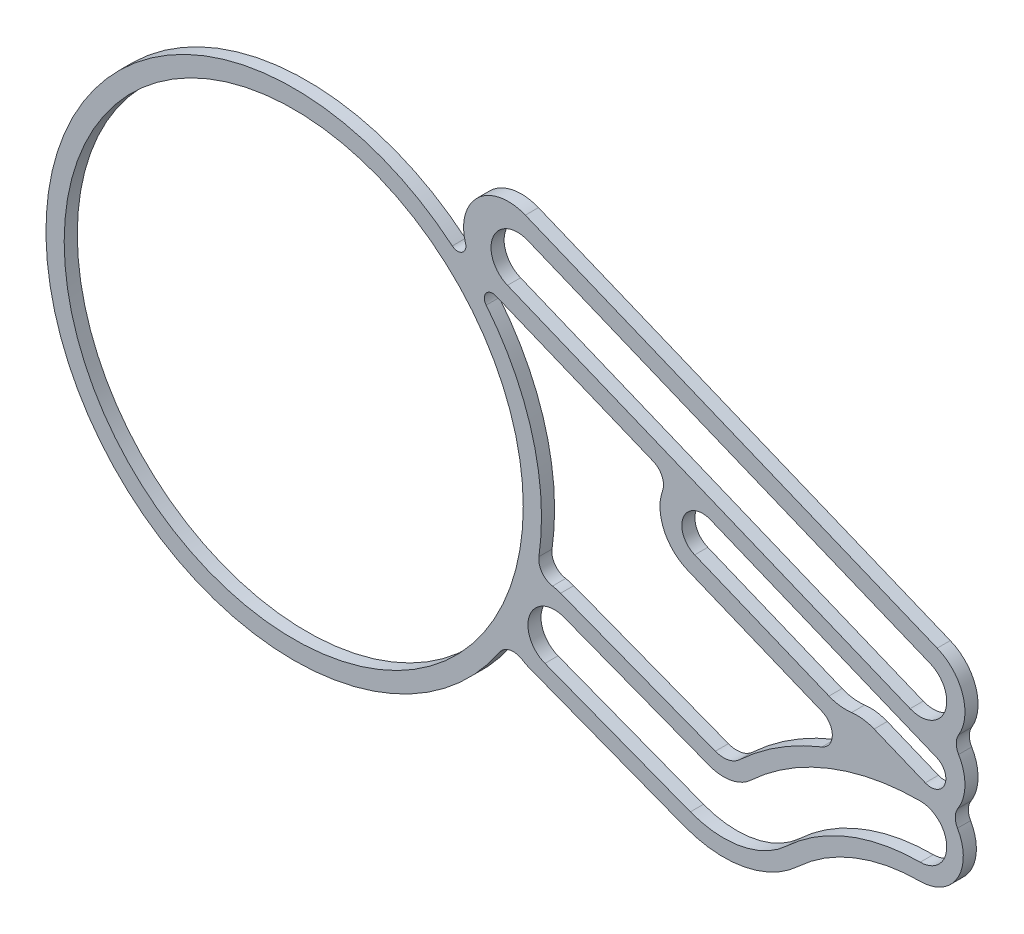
ISO-10303-21;
HEADER;
FILE_DESCRIPTION(('STEP AP214'),'2;1');
FILE_NAME('part.step','',(''),(''),'','','');
FILE_SCHEMA(('AUTOMOTIVE_DESIGN { 1 0 10303 214 1 1 1 1 }'));
ENDSEC;
DATA;
#1=APPLICATION_CONTEXT('core data for automotive mechanical design processes');
#2=APPLICATION_PROTOCOL_DEFINITION('international standard','automotive_design',2000,#1);
#3=PRODUCT_CONTEXT('',#1,'mechanical');
#4=PRODUCT('Part','Part','',(#3));
#5=PRODUCT_RELATED_PRODUCT_CATEGORY('part','',(#4));
#6=PRODUCT_DEFINITION_FORMATION('','',#4);
#7=PRODUCT_DEFINITION_CONTEXT('part definition',#1,'design');
#8=PRODUCT_DEFINITION('design','',#6,#7);
#9=PRODUCT_DEFINITION_SHAPE('','',#8);
#10=(LENGTH_UNIT() NAMED_UNIT(*) SI_UNIT(.MILLI.,.METRE.));
#11=(NAMED_UNIT(*) PLANE_ANGLE_UNIT() SI_UNIT($,.RADIAN.));
#12=(NAMED_UNIT(*) SI_UNIT($,.STERADIAN.) SOLID_ANGLE_UNIT());
#13=UNCERTAINTY_MEASURE_WITH_UNIT(LENGTH_MEASURE(1.E-05),#10,'distance_accuracy_value','');
#14=(GEOMETRIC_REPRESENTATION_CONTEXT(3) GLOBAL_UNCERTAINTY_ASSIGNED_CONTEXT((#13)) GLOBAL_UNIT_ASSIGNED_CONTEXT((#10,
#11,#12)) REPRESENTATION_CONTEXT('',''));
#15=CARTESIAN_POINT('',(0.,0.,0.));
#16=DIRECTION('',(0.,0.,1.));
#17=DIRECTION('',(1.,0.,0.));
#18=AXIS2_PLACEMENT_3D('',#15,#16,#17);
#19=CARTESIAN_POINT('',(31.4551259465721,-83.8715351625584,-1.74));
#20=DIRECTION('',(0.,0.,-1.));
#21=DIRECTION('',(-1.,0.,0.));
#22=AXIS2_PLACEMENT_3D('',#19,#20,#21);
#23=PLANE('',#22);
#24=DIRECTION('',(0.925101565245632,-0.379719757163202,0.));
#25=VECTOR('',#24,1.);
#26=CARTESIAN_POINT('',(41.9747566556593,-73.3617581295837,-1.74));
#27=LINE('',#26,#25);
#28=CARTESIAN_POINT('',(41.9747566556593,-73.3617581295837,-1.74));
#29=VERTEX_POINT('',#28);
#30=CARTESIAN_POINT('',(50.0769735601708,-76.6874165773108,-1.74));
#31=VERTEX_POINT('',#30);
#32=EDGE_CURVE('E482',#29,#31,#27,.T.);
#33=ORIENTED_EDGE('',*,*,#32,.F.);
#34=CARTESIAN_POINT('',(43.,-70.8639839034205,-1.74));
#35=DIRECTION('',(0.,0.,1.));
#36=DIRECTION('',(-1.,0.,0.));
#37=AXIS2_PLACEMENT_3D('',#34,#35,#36);
#38=CIRCLE('',#37,2.70000000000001);
#39=CARTESIAN_POINT('',(40.4541816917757,-69.9646457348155,-1.74));
#40=VERTEX_POINT('',#39);
#41=EDGE_CURVE('E480',#40,#29,#38,.T.);
#42=ORIENTED_EDGE('',*,*,#41,.F.);
#43=CARTESIAN_POINT('',(39.511286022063,-69.631557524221,-1.74));
#44=DIRECTION('',(0.,0.,-1.));
#45=DIRECTION('',(-1.,0.,0.));
#46=AXIS2_PLACEMENT_3D('',#43,#44,#45);
#47=CIRCLE('',#46,1.);
#48=CARTESIAN_POINT('',(39.8910057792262,-68.7064559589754,-1.74));
#49=VERTEX_POINT('',#48);
#50=EDGE_CURVE('E504',#49,#40,#47,.T.);
#51=ORIENTED_EDGE('',*,*,#50,.F.);
#52=DIRECTION('',(0.925101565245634,-0.379719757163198,0.));
#53=VECTOR('',#52,1.);
#54=CARTESIAN_POINT('',(30.3906632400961,-64.8069189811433,-1.74));
#55=LINE('',#54,#53);
#56=CARTESIAN_POINT('',(30.3906632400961,-64.8069189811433,-1.74));
#57=VERTEX_POINT('',#56);
#58=EDGE_CURVE('E501',#57,#49,#55,.T.);
#59=ORIENTED_EDGE('',*,*,#58,.F.);
#60=CARTESIAN_POINT('',(30.2008033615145,-65.2694697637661,-1.74));
#61=DIRECTION('',(0.,0.,-1.));
#62=DIRECTION('',(-1.,0.,0.));
#63=AXIS2_PLACEMENT_3D('',#60,#61,#62);
#64=CIRCLE('',#63,0.500000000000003);
#65=CARTESIAN_POINT('',(29.8124278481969,-65.5843736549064,-1.74));
#66=VERTEX_POINT('',#65);
#67=EDGE_CURVE('E499',#66,#57,#64,.T.);
#68=ORIENTED_EDGE('',*,*,#67,.F.);
#69=CARTESIAN_POINT('',(18.2,-75.,-1.74));
#70=DIRECTION('',(0.,0.,1.));
#71=DIRECTION('',(-1.,0.,0.));
#72=AXIS2_PLACEMENT_3D('',#69,#70,#71);
#73=CIRCLE('',#72,14.95);
#74=CARTESIAN_POINT('',(32.9969325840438,-77.1338430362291,-1.74));
#75=VERTEX_POINT('',#74);
#76=EDGE_CURVE('E497',#75,#66,#73,.T.);
#77=ORIENTED_EDGE('',*,*,#76,.F.);
#78=CARTESIAN_POINT('',(33.9866939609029,-77.2765750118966,-1.74));
#79=DIRECTION('',(0.,0.,-1.));
#80=DIRECTION('',(-1.,0.,0.));
#81=AXIS2_PLACEMENT_3D('',#78,#79,#80);
#82=CIRCLE('',#81,1.);
#83=CARTESIAN_POINT('',(33.8155795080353,-78.261826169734,-1.74));
#84=VERTEX_POINT('',#83);
#85=EDGE_CURVE('E495',#84,#75,#82,.T.);
#86=ORIENTED_EDGE('',*,*,#85,.F.);
#87=CARTESIAN_POINT('',(33.3706819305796,-80.823479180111,-1.74));
#88=DIRECTION('',(0.,0.,1.));
#89=DIRECTION('',(-1.,0.,0.));
#90=AXIS2_PLACEMENT_3D('',#87,#88,#89);
#91=CIRCLE('',#90,2.59999999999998);
#92=CARTESIAN_POINT('',(34.3024385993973,-78.3961700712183,-1.74));
#93=VERTEX_POINT('',#92);
#94=EDGE_CURVE('E493',#93,#84,#91,.T.);
#95=ORIENTED_EDGE('',*,*,#94,.F.);
#96=DIRECTION('',(-0.933580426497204,0.358367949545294,0.));
#97=VECTOR('',#96,1.);
#98=CARTESIAN_POINT('',(43.6382428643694,-81.9798495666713,-1.74));
#99=LINE('',#98,#97);
#100=CARTESIAN_POINT('',(43.6382428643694,-81.9798495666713,-1.74));
#101=VERTEX_POINT('',#100);
#102=EDGE_CURVE('E491',#101,#93,#99,.T.);
#103=ORIENTED_EDGE('',*,*,#102,.F.);
#104=CARTESIAN_POINT('',(44.1399579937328,-80.6728369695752,-1.74));
#105=DIRECTION('',(0.,0.,-1.));
#106=DIRECTION('',(-1.,0.,0.));
#107=AXIS2_PLACEMENT_3D('',#104,#105,#106);
#108=CIRCLE('',#107,1.4);
#109=CARTESIAN_POINT('',(45.0949114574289,-81.6965868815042,-1.74));
#110=VERTEX_POINT('',#109);
#111=EDGE_CURVE('E489',#110,#101,#108,.T.);
#112=ORIENTED_EDGE('',*,*,#111,.F.);
#113=CARTESIAN_POINT('',(56.,-93.3872962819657,-1.74));
#114=DIRECTION('',(0.,0.,1.));
#115=DIRECTION('',(-1.,0.,0.));
#116=AXIS2_PLACEMENT_3D('',#113,#114,#115);
#117=CIRCLE('',#116,15.9872962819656);
#118=CARTESIAN_POINT('',(50.0682808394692,-78.5411402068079,-1.74));
#119=VERTEX_POINT('',#118);
#120=EDGE_CURVE('E487',#119,#110,#117,.T.);
#121=ORIENTED_EDGE('',*,*,#120,.F.);
#122=CARTESIAN_POINT('',(49.6972538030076,-77.6125181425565,-1.74));
#123=DIRECTION('',(0.,0.,-1.));
#124=DIRECTION('',(-1.,0.,0.));
#125=AXIS2_PLACEMENT_3D('',#122,#123,#124);
#126=CIRCLE('',#125,0.999999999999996);
#127=EDGE_CURVE('E485',#31,#119,#126,.T.);
#128=ORIENTED_EDGE('',*,*,#127,.F.);
#129=EDGE_LOOP('',(#33,#42,#51,#59,#68,#77,#86,#95,#103,#112,#121,#128));
#130=FACE_BOUND('',#129,.T.);
#131=CARTESIAN_POINT('',(31.4551259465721,-83.8715351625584,-1.74));
#132=DIRECTION('',(0.,0.,1.));
#133=DIRECTION('',(-1.,0.,0.));
#134=AXIS2_PLACEMENT_3D('',#131,#132,#133);
#135=CIRCLE('',#134,0.999999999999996);
#136=CARTESIAN_POINT('',(31.9872248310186,-83.0248529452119,-1.74));
#137=VERTEX_POINT('',#136);
#138=CARTESIAN_POINT('',(30.6240835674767,-83.3153260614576,-1.74));
#139=VERTEX_POINT('',#138);
#140=EDGE_CURVE('E567',#137,#139,#135,.T.);
#141=ORIENTED_EDGE('',*,*,#140,.T.);
#142=CARTESIAN_POINT('',(18.2,-75.,-1.74));
#143=DIRECTION('',(0.,0.,-1.));
#144=DIRECTION('',(-1.,0.,0.));
#145=AXIS2_PLACEMENT_3D('',#142,#143,#144);
#146=CIRCLE('',#145,14.95);
#147=CARTESIAN_POINT('',(27.7676102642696,-63.5124705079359,-1.74));
#148=VERTEX_POINT('',#147);
#149=EDGE_CURVE('E570',#139,#148,#146,.T.);
#150=ORIENTED_EDGE('',*,*,#149,.T.);
#151=CARTESIAN_POINT('',(28.0875972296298,-63.1282721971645,-1.74));
#152=DIRECTION('',(0.,0.,1.));
#153=DIRECTION('',(-1.,0.,0.));
#154=AXIS2_PLACEMENT_3D('',#151,#152,#153);
#155=CIRCLE('',#154,0.499999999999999);
#156=CARTESIAN_POINT('',(28.5660976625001,-62.9832296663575,-1.74));
#157=VERTEX_POINT('',#156);
#158=EDGE_CURVE('E573',#148,#157,#155,.T.);
#159=ORIENTED_EDGE('',*,*,#158,.T.);
#160=CARTESIAN_POINT('',(31.15,-62.2,-1.74));
#161=DIRECTION('',(0.,0.,-1.));
#162=DIRECTION('',(-1.,0.,0.));
#163=AXIS2_PLACEMENT_3D('',#160,#161,#162);
#164=CIRCLE('',#163,2.70000000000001);
#165=CARTESIAN_POINT('',(32.1752433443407,-59.7022257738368,-1.74));
#166=VERTEX_POINT('',#165);
#167=EDGE_CURVE('E575',#157,#166,#164,.T.);
#168=ORIENTED_EDGE('',*,*,#167,.T.);
#169=DIRECTION('',(0.925101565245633,-0.379719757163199,0.));
#170=VECTOR('',#169,1.);
#171=CARTESIAN_POINT('',(32.1752433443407,-59.7022257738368,-1.74));
#172=LINE('',#171,#170);
#173=CARTESIAN_POINT('',(57.0252433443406,-69.9022257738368,-1.74));
#174=VERTEX_POINT('',#173);
#175=EDGE_CURVE('E577',#166,#174,#172,.T.);
#176=ORIENTED_EDGE('',*,*,#175,.T.);
#177=CARTESIAN_POINT('',(56.,-72.4,-1.74));
#178=DIRECTION('',(0.,0.,-1.));
#179=DIRECTION('',(-1.,0.,0.));
#180=AXIS2_PLACEMENT_3D('',#177,#178,#179);
#181=CIRCLE('',#180,2.7);
#182=CARTESIAN_POINT('',(58.3168200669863,-73.7864864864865,-1.74));
#183=VERTEX_POINT('',#182);
#184=EDGE_CURVE('E579',#174,#183,#181,.T.);
#185=ORIENTED_EDGE('',*,*,#184,.T.);
#186=CARTESIAN_POINT('',(59.1749015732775,-74.3,-1.74));
#187=DIRECTION('',(0.,0.,1.));
#188=DIRECTION('',(-1.,0.,0.));
#189=AXIS2_PLACEMENT_3D('',#186,#187,#188);
#190=CIRCLE('',#189,1.);
#191=CARTESIAN_POINT('',(58.3168200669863,-74.8135135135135,-1.74));
#192=VERTEX_POINT('',#191);
#193=EDGE_CURVE('E581',#183,#192,#190,.T.);
#194=ORIENTED_EDGE('',*,*,#193,.T.);
#195=CARTESIAN_POINT('',(56.,-76.2,-1.74));
#196=DIRECTION('',(0.,0.,-1.));
#197=DIRECTION('',(-1.,0.,0.));
#198=AXIS2_PLACEMENT_3D('',#195,#196,#197);
#199=CIRCLE('',#198,2.70000000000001);
#200=CARTESIAN_POINT('',(58.2734066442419,-77.6565789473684,-1.74));
#201=VERTEX_POINT('',#200);
#202=EDGE_CURVE('E583',#192,#201,#199,.T.);
#203=ORIENTED_EDGE('',*,*,#202,.T.);
#204=CARTESIAN_POINT('',(59.1154091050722,-78.196052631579,-1.74));
#205=DIRECTION('',(0.,0.,1.));
#206=DIRECTION('',(-1.,0.,0.));
#207=AXIS2_PLACEMENT_3D('',#204,#205,#206);
#208=CIRCLE('',#207,1.);
#209=CARTESIAN_POINT('',(58.2500176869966,-78.697149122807,-1.74));
#210=VERTEX_POINT('',#209);
#211=EDGE_CURVE('E585',#201,#210,#208,.T.);
#212=ORIENTED_EDGE('',*,*,#211,.T.);
#213=CARTESIAN_POINT('',(56.,-80.,-1.74));
#214=DIRECTION('',(0.,0.,-1.));
#215=DIRECTION('',(-1.,0.,0.));
#216=AXIS2_PLACEMENT_3D('',#213,#214,#215);
#217=CIRCLE('',#216,2.60000000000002);
#218=CARTESIAN_POINT('',(56.,-82.6,-1.74));
#219=VERTEX_POINT('',#218);
#220=EDGE_CURVE('E587',#210,#219,#217,.T.);
#221=ORIENTED_EDGE('',*,*,#220,.T.);
#222=CARTESIAN_POINT('',(56.,-93.3872962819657,-1.74));
#223=DIRECTION('',(0.,0.,1.));
#224=DIRECTION('',(-1.,0.,0.));
#225=AXIS2_PLACEMENT_3D('',#222,#223,#224);
#226=CIRCLE('',#225,10.7872962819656);
#227=CARTESIAN_POINT('',(48.6418814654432,-85.4990865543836,-1.74));
#228=VERTEX_POINT('',#227);
#229=EDGE_CURVE('E589',#219,#228,#226,.T.);
#230=ORIENTED_EDGE('',*,*,#229,.T.);
#231=CARTESIAN_POINT('',(44.1399579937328,-80.6728369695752,-1.74));
#232=DIRECTION('',(0.,0.,-1.));
#233=DIRECTION('',(-1.,0.,0.));
#234=AXIS2_PLACEMENT_3D('',#231,#232,#233);
#235=CIRCLE('',#234,6.6);
#236=CARTESIAN_POINT('',(41.7747295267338,-86.8344677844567,-1.74));
#237=VERTEX_POINT('',#236);
#238=EDGE_CURVE('E591',#228,#237,#235,.T.);
#239=ORIENTED_EDGE('',*,*,#238,.T.);
#240=DIRECTION('',(-0.933580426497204,0.358367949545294,0.));
#241=VECTOR('',#240,1.);
#242=CARTESIAN_POINT('',(41.7747295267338,-86.8344677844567,-1.74));
#243=LINE('',#242,#241);
#244=CARTESIAN_POINT('',(32.4389252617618,-83.2507882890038,-1.74));
#245=VERTEX_POINT('',#244);
#246=EDGE_CURVE('E593',#237,#245,#243,.T.);
#247=ORIENTED_EDGE('',*,*,#246,.T.);
#248=CARTESIAN_POINT('',(33.3706819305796,-80.823479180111,-1.74));
#249=DIRECTION('',(0.,0.,-1.));
#250=DIRECTION('',(-1.,0.,0.));
#251=AXIS2_PLACEMENT_3D('',#248,#249,#250);
#252=CIRCLE('',#251,2.60000000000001);
#253=EDGE_CURVE('E595',#245,#137,#252,.T.);
#254=ORIENTED_EDGE('',*,*,#253,.T.);
#255=EDGE_LOOP('',(#141,#150,#159,#168,#176,#185,#194,#203,#212,#221,#230,#239,#247,#254));
#256=FACE_BOUND('',#255,.T.);
#257=CARTESIAN_POINT('',(18.2,-75.,-1.74));
#258=DIRECTION('',(0.,0.,-1.));
#259=DIRECTION('',(-1.,0.,0.));
#260=AXIS2_PLACEMENT_3D('',#257,#258,#259);
#261=CIRCLE('',#260,13.85);
#262=CARTESIAN_POINT('',(32.05,-75.,-1.74));
#263=VERTEX_POINT('',#262);
#264=EDGE_CURVE('E474',#263,#263,#261,.T.);
#265=ORIENTED_EDGE('',*,*,#264,.F.);
#266=EDGE_LOOP('',(#265));
#267=FACE_BOUND('',#266,.T.);
#268=CARTESIAN_POINT('',(51.519908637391,-73.1720306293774,-1.74));
#269=DIRECTION('',(0.,0.,-1.));
#270=DIRECTION('',(-1.,0.,0.));
#271=AXIS2_PLACEMENT_3D('',#268,#269,#270);
#272=CIRCLE('',#271,2.69999999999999);
#273=CARTESIAN_POINT('',(51.8574652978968,-75.8508466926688,-1.74));
#274=VERTEX_POINT('',#273);
#275=CARTESIAN_POINT('',(50.4946652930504,-75.6698048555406,-1.74));
#276=VERTEX_POINT('',#275);
#277=EDGE_CURVE('E424',#274,#276,#272,.T.);
#278=ORIENTED_EDGE('',*,*,#277,.F.);
#279=CARTESIAN_POINT('',(52.1950219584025,-78.5296627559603,-1.74));
#280=DIRECTION('',(0.,0.,1.));
#281=DIRECTION('',(1.,0.,0.));
#282=AXIS2_PLACEMENT_3D('',#279,#280,#281);
#283=CIRCLE('',#282,2.69999999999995);
#284=CARTESIAN_POINT('',(53.2202653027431,-76.0318885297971,-1.74));
#285=VERTEX_POINT('',#284);
#286=EDGE_CURVE('E422',#285,#274,#283,.T.);
#287=ORIENTED_EDGE('',*,*,#286,.F.);
#288=DIRECTION('',(-0.925101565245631,0.379719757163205,0.));
#289=VECTOR('',#288,1.);
#290=CARTESIAN_POINT('',(53.2202653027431,-76.0318885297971,-1.74));
#291=LINE('',#290,#289);
#292=CARTESIAN_POINT('',(56.305823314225,-77.2983952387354,-1.74));
#293=VERTEX_POINT('',#292);
#294=EDGE_CURVE('E436',#293,#285,#291,.T.);
#295=ORIENTED_EDGE('',*,*,#294,.F.);
#296=CARTESIAN_POINT('',(56.647571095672,-76.4658038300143,-1.74));
#297=DIRECTION('',(0.,0.,-1.));
#298=DIRECTION('',(-1.,0.,0.));
#299=AXIS2_PLACEMENT_3D('',#296,#297,#298);
#300=CIRCLE('',#299,0.900000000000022);
#301=CARTESIAN_POINT('',(56.9893188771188,-75.6332124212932,-1.74));
#302=VERTEX_POINT('',#301);
#303=EDGE_CURVE('E433',#302,#293,#300,.T.);
#304=ORIENTED_EDGE('',*,*,#303,.F.);
#305=DIRECTION('',(0.925101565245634,-0.379719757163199,0.));
#306=VECTOR('',#305,1.);
#307=CARTESIAN_POINT('',(56.9893188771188,-75.6332124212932,-1.74));
#308=LINE('',#307,#306);
#309=CARTESIAN_POINT('',(43.3417477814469,-70.0313924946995,-1.74));
#310=VERTEX_POINT('',#309);
#311=EDGE_CURVE('E431',#310,#302,#308,.T.);
#312=ORIENTED_EDGE('',*,*,#311,.F.);
#313=CARTESIAN_POINT('',(42.8670980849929,-71.1877694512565,-1.74));
#314=DIRECTION('',(0.,0.,-1.));
#315=DIRECTION('',(1.,0.,0.));
#316=AXIS2_PLACEMENT_3D('',#313,#314,#315);
#317=CIRCLE('',#316,1.25);
#318=CARTESIAN_POINT('',(42.3924483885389,-72.3441464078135,-1.74));
#319=VERTEX_POINT('',#318);
#320=EDGE_CURVE('E429',#319,#310,#317,.T.);
#321=ORIENTED_EDGE('',*,*,#320,.F.);
#322=DIRECTION('',(-0.925101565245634,0.379719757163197,0.));
#323=VECTOR('',#322,1.);
#324=CARTESIAN_POINT('',(42.3924483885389,-72.3441464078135,-1.74));
#325=LINE('',#324,#323);
#326=EDGE_CURVE('E427',#276,#319,#325,.T.);
#327=ORIENTED_EDGE('',*,*,#326,.F.);
#328=EDGE_LOOP('',(#278,#287,#295,#304,#312,#321,#327));
#329=FACE_BOUND('',#328,.T.);
#330=DIRECTION('',(-0.925101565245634,0.379719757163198,0.));
#331=VECTOR('',#330,1.);
#332=CARTESIAN_POINT('',(55.3924483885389,-73.880162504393,-1.74));
#333=LINE('',#332,#331);
#334=CARTESIAN_POINT('',(55.3924483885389,-73.880162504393,-1.74));
#335=VERTEX_POINT('',#334);
#336=CARTESIAN_POINT('',(31.0975093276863,-63.9079943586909,-1.74));
#337=VERTEX_POINT('',#336);
#338=EDGE_CURVE('E393',#335,#337,#333,.T.);
#339=ORIENTED_EDGE('',*,*,#338,.F.);
#340=CARTESIAN_POINT('',(56.,-72.4,-1.74));
#341=DIRECTION('',(0.,0.,-1.));
#342=DIRECTION('',(-1.,0.,0.));
#343=AXIS2_PLACEMENT_3D('',#340,#341,#342);
#344=CIRCLE('',#343,1.6);
#345=CARTESIAN_POINT('',(56.6075516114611,-70.919837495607,-1.74));
#346=VERTEX_POINT('',#345);
#347=EDGE_CURVE('E391',#346,#335,#344,.T.);
#348=ORIENTED_EDGE('',*,*,#347,.F.);
#349=DIRECTION('',(0.925101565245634,-0.379719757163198,0.));
#350=VECTOR('',#349,1.);
#351=CARTESIAN_POINT('',(32.3126125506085,-60.9476693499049,-1.74));
#352=LINE('',#351,#350);
#353=CARTESIAN_POINT('',(32.3126125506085,-60.9476693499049,-1.74));
#354=VERTEX_POINT('',#353);
#355=EDGE_CURVE('E399',#354,#346,#352,.T.);
#356=ORIENTED_EDGE('',*,*,#355,.F.);
#357=CARTESIAN_POINT('',(31.7050609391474,-62.4278318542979,-1.74));
#358=DIRECTION('',(0.,0.,-1.));
#359=DIRECTION('',(1.,0.,0.));
#360=AXIS2_PLACEMENT_3D('',#357,#358,#359);
#361=CIRCLE('',#360,1.6);
#362=EDGE_CURVE('E396',#337,#354,#361,.T.);
#363=ORIENTED_EDGE('',*,*,#362,.F.);
#364=EDGE_LOOP('',(#339,#348,#356,#363));
#365=FACE_BOUND('',#364,.T.);
#366=CARTESIAN_POINT('',(56.,-80.,-1.74));
#367=DIRECTION('',(0.,0.,-1.));
#368=DIRECTION('',(-1.,0.,0.));
#369=AXIS2_PLACEMENT_3D('',#366,#367,#368);
#370=CIRCLE('',#369,1.59999999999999);
#371=CARTESIAN_POINT('',(56.,-78.4,-1.74));
#372=VERTEX_POINT('',#371);
#373=CARTESIAN_POINT('',(56.,-81.6,-1.74));
#374=VERTEX_POINT('',#373);
#375=EDGE_CURVE('E334',#372,#374,#370,.T.);
#376=ORIENTED_EDGE('',*,*,#375,.F.);
#377=CARTESIAN_POINT('',(56.,-93.3872962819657,-1.74));
#378=DIRECTION('',(0.,0.,-1.));
#379=DIRECTION('',(-1.,0.,0.));
#380=AXIS2_PLACEMENT_3D('',#377,#378,#379);
#381=CIRCLE('',#380,14.9872962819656);
#382=CARTESIAN_POINT('',(45.7770210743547,-82.4278368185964,-1.74));
#383=VERTEX_POINT('',#382);
#384=EDGE_CURVE('E326',#383,#372,#381,.T.);
#385=ORIENTED_EDGE('',*,*,#384,.F.);
#386=CARTESIAN_POINT('',(44.1399579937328,-80.6728369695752,-1.74));
#387=DIRECTION('',(0.,0.,1.));
#388=DIRECTION('',(-1.,0.,0.));
#389=AXIS2_PLACEMENT_3D('',#386,#387,#388);
#390=CIRCLE('',#389,2.4);
#391=CARTESIAN_POINT('',(43.2798749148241,-82.9134299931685,-1.74));
#392=VERTEX_POINT('',#391);
#393=EDGE_CURVE('E359',#392,#383,#390,.T.);
#394=ORIENTED_EDGE('',*,*,#393,.F.);
#395=DIRECTION('',(0.933580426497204,-0.358367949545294,0.));
#396=VECTOR('',#395,1.);
#397=CARTESIAN_POINT('',(34.5042189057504,-79.5447712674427,-1.74));
#398=LINE('',#397,#396);
#399=CARTESIAN_POINT('',(34.5042189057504,-79.5447712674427,-1.74));
#400=VERTEX_POINT('',#399);
#401=EDGE_CURVE('E357',#400,#392,#398,.T.);
#402=ORIENTED_EDGE('',*,*,#401,.F.);
#403=CARTESIAN_POINT('',(33.9308301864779,-81.0384999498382,-1.74));
#404=DIRECTION('',(0.,0.,-1.));
#405=DIRECTION('',(1.,0.,0.));
#406=AXIS2_PLACEMENT_3D('',#403,#404,#405);
#407=CIRCLE('',#406,1.59999999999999);
#408=CARTESIAN_POINT('',(33.3574414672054,-82.5322286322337,-1.74));
#409=VERTEX_POINT('',#408);
#410=EDGE_CURVE('E355',#409,#400,#407,.T.);
#411=ORIENTED_EDGE('',*,*,#410,.F.);
#412=DIRECTION('',(-0.933580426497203,0.358367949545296,0.));
#413=VECTOR('',#412,1.);
#414=CARTESIAN_POINT('',(42.1330974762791,-85.9008873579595,-1.74));
#415=LINE('',#414,#413);
#416=CARTESIAN_POINT('',(42.1330974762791,-85.9008873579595,-1.74));
#417=VERTEX_POINT('',#416);
#418=EDGE_CURVE('E353',#417,#409,#415,.T.);
#419=ORIENTED_EDGE('',*,*,#418,.F.);
#420=CARTESIAN_POINT('',(44.1399579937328,-80.6728369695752,-1.74));
#421=DIRECTION('',(0.,0.,-1.));
#422=DIRECTION('',(-1.,0.,0.));
#423=AXIS2_PLACEMENT_3D('',#420,#421,#422);
#424=CIRCLE('',#423,5.6);
#425=CARTESIAN_POINT('',(47.9597718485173,-84.7678366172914,-1.74));
#426=VERTEX_POINT('',#425);
#427=EDGE_CURVE('E349',#426,#417,#424,.T.);
#428=ORIENTED_EDGE('',*,*,#427,.F.);
#429=CARTESIAN_POINT('',(56.,-93.3872962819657,-1.74));
#430=DIRECTION('',(0.,0.,1.));
#431=DIRECTION('',(-1.,0.,0.));
#432=AXIS2_PLACEMENT_3D('',#429,#430,#431);
#433=CIRCLE('',#432,11.7872962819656);
#434=EDGE_CURVE('E347',#374,#426,#433,.T.);
#435=ORIENTED_EDGE('',*,*,#434,.F.);
#436=EDGE_LOOP('',(#376,#385,#394,#402,#411,#419,#428,#435));
#437=FACE_BOUND('',#436,.T.);
#438=ADVANCED_FACE('F39',(#130,#256,#267,#329,#365,#437),#23,.T.);
#439=CARTESIAN_POINT('',(31.4551259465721,-83.8715351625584,-0.95));
#440=DIRECTION('',(0.,0.,-1.));
#441=DIRECTION('',(-1.,0.,0.));
#442=AXIS2_PLACEMENT_3D('',#439,#440,#441);
#443=PLANE('',#442);
#444=CARTESIAN_POINT('',(56.,-72.4,-0.95));
#445=DIRECTION('',(0.,0.,-1.));
#446=DIRECTION('',(-1.,0.,0.));
#447=AXIS2_PLACEMENT_3D('',#444,#445,#446);
#448=CIRCLE('',#447,1.6);
#449=CARTESIAN_POINT('',(56.6075516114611,-70.919837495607,-0.95));
#450=VERTEX_POINT('',#449);
#451=CARTESIAN_POINT('',(55.3924483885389,-73.880162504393,-0.95));
#452=VERTEX_POINT('',#451);
#453=EDGE_CURVE('E342',#450,#452,#448,.T.);
#454=ORIENTED_EDGE('',*,*,#453,.T.);
#455=DIRECTION('',(-0.925101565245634,0.379719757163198,0.));
#456=VECTOR('',#455,1.);
#457=CARTESIAN_POINT('',(55.3924483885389,-73.880162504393,-0.95));
#458=LINE('',#457,#456);
#459=CARTESIAN_POINT('',(31.0975093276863,-63.9079943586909,-0.95));
#460=VERTEX_POINT('',#459);
#461=EDGE_CURVE('E404',#452,#460,#458,.T.);
#462=ORIENTED_EDGE('',*,*,#461,.T.);
#463=CARTESIAN_POINT('',(31.7050609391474,-62.4278318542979,-0.95));
#464=DIRECTION('',(0.,0.,-1.));
#465=DIRECTION('',(1.,0.,0.));
#466=AXIS2_PLACEMENT_3D('',#463,#464,#465);
#467=CIRCLE('',#466,1.6);
#468=CARTESIAN_POINT('',(32.3126125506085,-60.9476693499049,-0.95));
#469=VERTEX_POINT('',#468);
#470=EDGE_CURVE('E407',#460,#469,#467,.T.);
#471=ORIENTED_EDGE('',*,*,#470,.T.);
#472=DIRECTION('',(0.925101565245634,-0.379719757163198,0.));
#473=VECTOR('',#472,1.);
#474=CARTESIAN_POINT('',(32.3126125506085,-60.9476693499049,-0.95));
#475=LINE('',#474,#473);
#476=EDGE_CURVE('E394',#469,#450,#475,.T.);
#477=ORIENTED_EDGE('',*,*,#476,.T.);
#478=EDGE_LOOP('',(#454,#462,#471,#477));
#479=FACE_BOUND('',#478,.T.);
#480=CARTESIAN_POINT('',(18.2,-75.,-0.95));
#481=DIRECTION('',(0.,0.,-1.));
#482=DIRECTION('',(-1.,0.,0.));
#483=AXIS2_PLACEMENT_3D('',#480,#481,#482);
#484=CIRCLE('',#483,13.85);
#485=CARTESIAN_POINT('',(32.05,-75.,-0.95));
#486=VERTEX_POINT('',#485);
#487=EDGE_CURVE('E473',#486,#486,#484,.T.);
#488=ORIENTED_EDGE('',*,*,#487,.T.);
#489=EDGE_LOOP('',(#488));
#490=FACE_BOUND('',#489,.T.);
#491=CARTESIAN_POINT('',(43.,-70.8639839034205,-0.95));
#492=DIRECTION('',(0.,0.,1.));
#493=DIRECTION('',(-1.,0.,0.));
#494=AXIS2_PLACEMENT_3D('',#491,#492,#493);
#495=CIRCLE('',#494,2.70000000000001);
#496=CARTESIAN_POINT('',(40.4541816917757,-69.9646457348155,-0.95));
#497=VERTEX_POINT('',#496);
#498=CARTESIAN_POINT('',(41.9747566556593,-73.3617581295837,-0.95));
#499=VERTEX_POINT('',#498);
#500=EDGE_CURVE('E477',#497,#499,#495,.T.);
#501=ORIENTED_EDGE('',*,*,#500,.T.);
#502=DIRECTION('',(0.925101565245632,-0.379719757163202,0.));
#503=VECTOR('',#502,1.);
#504=CARTESIAN_POINT('',(41.9747566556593,-73.3617581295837,-0.95));
#505=LINE('',#504,#503);
#506=CARTESIAN_POINT('',(50.0769735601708,-76.6874165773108,-0.95));
#507=VERTEX_POINT('',#506);
#508=EDGE_CURVE('E509',#499,#507,#505,.T.);
#509=ORIENTED_EDGE('',*,*,#508,.T.);
#510=CARTESIAN_POINT('',(49.6972538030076,-77.6125181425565,-0.95));
#511=DIRECTION('',(0.,0.,-1.));
#512=DIRECTION('',(-1.,0.,0.));
#513=AXIS2_PLACEMENT_3D('',#510,#511,#512);
#514=CIRCLE('',#513,0.999999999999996);
#515=CARTESIAN_POINT('',(50.0682808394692,-78.5411402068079,-0.95));
#516=VERTEX_POINT('',#515);
#517=EDGE_CURVE('E512',#507,#516,#514,.T.);
#518=ORIENTED_EDGE('',*,*,#517,.T.);
#519=CARTESIAN_POINT('',(56.,-93.3872962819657,-0.95));
#520=DIRECTION('',(0.,0.,1.));
#521=DIRECTION('',(-1.,0.,0.));
#522=AXIS2_PLACEMENT_3D('',#519,#520,#521);
#523=CIRCLE('',#522,15.9872962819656);
#524=CARTESIAN_POINT('',(45.0949114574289,-81.6965868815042,-0.95));
#525=VERTEX_POINT('',#524);
#526=EDGE_CURVE('E515',#516,#525,#523,.T.);
#527=ORIENTED_EDGE('',*,*,#526,.T.);
#528=CARTESIAN_POINT('',(44.1399579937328,-80.6728369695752,-0.95));
#529=DIRECTION('',(0.,0.,-1.));
#530=DIRECTION('',(-1.,0.,0.));
#531=AXIS2_PLACEMENT_3D('',#528,#529,#530);
#532=CIRCLE('',#531,1.4);
#533=CARTESIAN_POINT('',(43.6382428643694,-81.9798495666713,-0.95));
#534=VERTEX_POINT('',#533);
#535=EDGE_CURVE('E518',#525,#534,#532,.T.);
#536=ORIENTED_EDGE('',*,*,#535,.T.);
#537=DIRECTION('',(-0.933580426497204,0.358367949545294,0.));
#538=VECTOR('',#537,1.);
#539=CARTESIAN_POINT('',(43.6382428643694,-81.9798495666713,-0.95));
#540=LINE('',#539,#538);
#541=CARTESIAN_POINT('',(34.3024385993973,-78.3961700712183,-0.95));
#542=VERTEX_POINT('',#541);
#543=EDGE_CURVE('E521',#534,#542,#540,.T.);
#544=ORIENTED_EDGE('',*,*,#543,.T.);
#545=CARTESIAN_POINT('',(33.3706819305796,-80.823479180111,-0.95));
#546=DIRECTION('',(0.,0.,1.));
#547=DIRECTION('',(-1.,0.,0.));
#548=AXIS2_PLACEMENT_3D('',#545,#546,#547);
#549=CIRCLE('',#548,2.59999999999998);
#550=CARTESIAN_POINT('',(33.8155795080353,-78.261826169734,-0.95));
#551=VERTEX_POINT('',#550);
#552=EDGE_CURVE('E524',#542,#551,#549,.T.);
#553=ORIENTED_EDGE('',*,*,#552,.T.);
#554=CARTESIAN_POINT('',(33.9866939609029,-77.2765750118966,-0.95));
#555=DIRECTION('',(0.,0.,-1.));
#556=DIRECTION('',(-1.,0.,0.));
#557=AXIS2_PLACEMENT_3D('',#554,#555,#556);
#558=CIRCLE('',#557,1.);
#559=CARTESIAN_POINT('',(32.9969325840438,-77.1338430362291,-0.95));
#560=VERTEX_POINT('',#559);
#561=EDGE_CURVE('E527',#551,#560,#558,.T.);
#562=ORIENTED_EDGE('',*,*,#561,.T.);
#563=CARTESIAN_POINT('',(18.2,-75.,-0.95));
#564=DIRECTION('',(0.,0.,1.));
#565=DIRECTION('',(-1.,0.,0.));
#566=AXIS2_PLACEMENT_3D('',#563,#564,#565);
#567=CIRCLE('',#566,14.95);
#568=CARTESIAN_POINT('',(29.8124278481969,-65.5843736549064,-0.95));
#569=VERTEX_POINT('',#568);
#570=EDGE_CURVE('E530',#560,#569,#567,.T.);
#571=ORIENTED_EDGE('',*,*,#570,.T.);
#572=CARTESIAN_POINT('',(30.2008033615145,-65.2694697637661,-0.95));
#573=DIRECTION('',(0.,0.,-1.));
#574=DIRECTION('',(-1.,0.,0.));
#575=AXIS2_PLACEMENT_3D('',#572,#573,#574);
#576=CIRCLE('',#575,0.500000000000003);
#577=CARTESIAN_POINT('',(30.3906632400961,-64.8069189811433,-0.95));
#578=VERTEX_POINT('',#577);
#579=EDGE_CURVE('E533',#569,#578,#576,.T.);
#580=ORIENTED_EDGE('',*,*,#579,.T.);
#581=DIRECTION('',(0.925101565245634,-0.379719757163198,0.));
#582=VECTOR('',#581,1.);
#583=CARTESIAN_POINT('',(30.3906632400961,-64.8069189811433,-0.95));
#584=LINE('',#583,#582);
#585=CARTESIAN_POINT('',(39.8910057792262,-68.7064559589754,-0.95));
#586=VERTEX_POINT('',#585);
#587=EDGE_CURVE('E536',#578,#586,#584,.T.);
#588=ORIENTED_EDGE('',*,*,#587,.T.);
#589=CARTESIAN_POINT('',(39.511286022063,-69.631557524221,-0.95));
#590=DIRECTION('',(0.,0.,-1.));
#591=DIRECTION('',(-1.,0.,0.));
#592=AXIS2_PLACEMENT_3D('',#589,#590,#591);
#593=CIRCLE('',#592,1.);
#594=EDGE_CURVE('E483',#586,#497,#593,.T.);
#595=ORIENTED_EDGE('',*,*,#594,.T.);
#596=EDGE_LOOP('',(#501,#509,#518,#527,#536,#544,#553,#562,#571,#580,#588,#595));
#597=FACE_BOUND('',#596,.T.);
#598=CARTESIAN_POINT('',(31.4551259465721,-83.8715351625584,-0.95));
#599=DIRECTION('',(0.,0.,1.));
#600=DIRECTION('',(-1.,0.,0.));
#601=AXIS2_PLACEMENT_3D('',#598,#599,#600);
#602=CIRCLE('',#601,0.999999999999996);
#603=CARTESIAN_POINT('',(31.9872248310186,-83.0248529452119,-0.95));
#604=VERTEX_POINT('',#603);
#605=CARTESIAN_POINT('',(30.6240835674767,-83.3153260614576,-0.95));
#606=VERTEX_POINT('',#605);
#607=EDGE_CURVE('E566',#604,#606,#602,.T.);
#608=ORIENTED_EDGE('',*,*,#607,.F.);
#609=CARTESIAN_POINT('',(33.3706819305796,-80.823479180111,-0.95));
#610=DIRECTION('',(0.,0.,-1.));
#611=DIRECTION('',(-1.,0.,0.));
#612=AXIS2_PLACEMENT_3D('',#609,#610,#611);
#613=CIRCLE('',#612,2.60000000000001);
#614=CARTESIAN_POINT('',(32.4389252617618,-83.2507882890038,-0.95));
#615=VERTEX_POINT('',#614);
#616=EDGE_CURVE('E571',#615,#604,#613,.T.);
#617=ORIENTED_EDGE('',*,*,#616,.F.);
#618=DIRECTION('',(-0.933580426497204,0.358367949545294,0.));
#619=VECTOR('',#618,1.);
#620=CARTESIAN_POINT('',(41.7747295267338,-86.8344677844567,-0.95));
#621=LINE('',#620,#619);
#622=CARTESIAN_POINT('',(41.7747295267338,-86.8344677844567,-0.95));
#623=VERTEX_POINT('',#622);
#624=EDGE_CURVE('E622',#623,#615,#621,.T.);
#625=ORIENTED_EDGE('',*,*,#624,.F.);
#626=CARTESIAN_POINT('',(44.1399579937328,-80.6728369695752,-0.95));
#627=DIRECTION('',(0.,0.,-1.));
#628=DIRECTION('',(-1.,0.,0.));
#629=AXIS2_PLACEMENT_3D('',#626,#627,#628);
#630=CIRCLE('',#629,6.6);
#631=CARTESIAN_POINT('',(48.6418814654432,-85.4990865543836,-0.95));
#632=VERTEX_POINT('',#631);
#633=EDGE_CURVE('E620',#632,#623,#630,.T.);
#634=ORIENTED_EDGE('',*,*,#633,.F.);
#635=CARTESIAN_POINT('',(56.,-93.3872962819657,-0.95));
#636=DIRECTION('',(0.,0.,1.));
#637=DIRECTION('',(-1.,0.,0.));
#638=AXIS2_PLACEMENT_3D('',#635,#636,#637);
#639=CIRCLE('',#638,10.7872962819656);
#640=CARTESIAN_POINT('',(56.,-82.6,-0.95));
#641=VERTEX_POINT('',#640);
#642=EDGE_CURVE('E618',#641,#632,#639,.T.);
#643=ORIENTED_EDGE('',*,*,#642,.F.);
#644=CARTESIAN_POINT('',(56.,-80.,-0.95));
#645=DIRECTION('',(0.,0.,-1.));
#646=DIRECTION('',(-1.,0.,0.));
#647=AXIS2_PLACEMENT_3D('',#644,#645,#646);
#648=CIRCLE('',#647,2.60000000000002);
#649=CARTESIAN_POINT('',(58.2500176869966,-78.697149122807,-0.95));
#650=VERTEX_POINT('',#649);
#651=EDGE_CURVE('E616',#650,#641,#648,.T.);
#652=ORIENTED_EDGE('',*,*,#651,.F.);
#653=CARTESIAN_POINT('',(59.1154091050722,-78.196052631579,-0.95));
#654=DIRECTION('',(0.,0.,1.));
#655=DIRECTION('',(-1.,0.,0.));
#656=AXIS2_PLACEMENT_3D('',#653,#654,#655);
#657=CIRCLE('',#656,1.);
#658=CARTESIAN_POINT('',(58.2734066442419,-77.6565789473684,-0.95));
#659=VERTEX_POINT('',#658);
#660=EDGE_CURVE('E614',#659,#650,#657,.T.);
#661=ORIENTED_EDGE('',*,*,#660,.F.);
#662=CARTESIAN_POINT('',(56.,-76.2,-0.95));
#663=DIRECTION('',(0.,0.,-1.));
#664=DIRECTION('',(-1.,0.,0.));
#665=AXIS2_PLACEMENT_3D('',#662,#663,#664);
#666=CIRCLE('',#665,2.70000000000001);
#667=CARTESIAN_POINT('',(58.3168200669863,-74.8135135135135,-0.95));
#668=VERTEX_POINT('',#667);
#669=EDGE_CURVE('E612',#668,#659,#666,.T.);
#670=ORIENTED_EDGE('',*,*,#669,.F.);
#671=CARTESIAN_POINT('',(59.1749015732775,-74.3,-0.95));
#672=DIRECTION('',(0.,0.,1.));
#673=DIRECTION('',(-1.,0.,0.));
#674=AXIS2_PLACEMENT_3D('',#671,#672,#673);
#675=CIRCLE('',#674,1.);
#676=CARTESIAN_POINT('',(58.3168200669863,-73.7864864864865,-0.95));
#677=VERTEX_POINT('',#676);
#678=EDGE_CURVE('E610',#677,#668,#675,.T.);
#679=ORIENTED_EDGE('',*,*,#678,.F.);
#680=CARTESIAN_POINT('',(56.,-72.4,-0.95));
#681=DIRECTION('',(0.,0.,-1.));
#682=DIRECTION('',(-1.,0.,0.));
#683=AXIS2_PLACEMENT_3D('',#680,#681,#682);
#684=CIRCLE('',#683,2.7);
#685=CARTESIAN_POINT('',(57.0252433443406,-69.9022257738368,-0.95));
#686=VERTEX_POINT('',#685);
#687=EDGE_CURVE('E608',#686,#677,#684,.T.);
#688=ORIENTED_EDGE('',*,*,#687,.F.);
#689=DIRECTION('',(0.925101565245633,-0.379719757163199,0.));
#690=VECTOR('',#689,1.);
#691=CARTESIAN_POINT('',(32.1752433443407,-59.7022257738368,-0.95));
#692=LINE('',#691,#690);
#693=CARTESIAN_POINT('',(32.1752433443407,-59.7022257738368,-0.95));
#694=VERTEX_POINT('',#693);
#695=EDGE_CURVE('E606',#694,#686,#692,.T.);
#696=ORIENTED_EDGE('',*,*,#695,.F.);
#697=CARTESIAN_POINT('',(31.15,-62.2,-0.95));
#698=DIRECTION('',(0.,0.,-1.));
#699=DIRECTION('',(-1.,0.,0.));
#700=AXIS2_PLACEMENT_3D('',#697,#698,#699);
#701=CIRCLE('',#700,2.70000000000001);
#702=CARTESIAN_POINT('',(28.5660976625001,-62.9832296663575,-0.95));
#703=VERTEX_POINT('',#702);
#704=EDGE_CURVE('E604',#703,#694,#701,.T.);
#705=ORIENTED_EDGE('',*,*,#704,.F.);
#706=CARTESIAN_POINT('',(28.0875972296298,-63.1282721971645,-0.95));
#707=DIRECTION('',(0.,0.,1.));
#708=DIRECTION('',(-1.,0.,0.));
#709=AXIS2_PLACEMENT_3D('',#706,#707,#708);
#710=CIRCLE('',#709,0.499999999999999);
#711=CARTESIAN_POINT('',(27.7676102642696,-63.5124705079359,-0.95));
#712=VERTEX_POINT('',#711);
#713=EDGE_CURVE('E602',#712,#703,#710,.T.);
#714=ORIENTED_EDGE('',*,*,#713,.F.);
#715=CARTESIAN_POINT('',(18.2,-75.,-0.95));
#716=DIRECTION('',(0.,0.,-1.));
#717=DIRECTION('',(-1.,0.,0.));
#718=AXIS2_PLACEMENT_3D('',#715,#716,#717);
#719=CIRCLE('',#718,14.95);
#720=EDGE_CURVE('E600',#606,#712,#719,.T.);
#721=ORIENTED_EDGE('',*,*,#720,.F.);
#722=EDGE_LOOP('',(#608,#617,#625,#634,#643,#652,#661,#670,#679,#688,#696,#705,#714,#721));
#723=FACE_BOUND('',#722,.T.);
#724=CARTESIAN_POINT('',(52.1950219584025,-78.5296627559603,-0.95));
#725=DIRECTION('',(0.,0.,1.));
#726=DIRECTION('',(1.,0.,0.));
#727=AXIS2_PLACEMENT_3D('',#724,#725,#726);
#728=CIRCLE('',#727,2.69999999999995);
#729=CARTESIAN_POINT('',(53.2202653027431,-76.0318885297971,-0.95));
#730=VERTEX_POINT('',#729);
#731=CARTESIAN_POINT('',(51.8574652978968,-75.8508466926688,-0.95));
#732=VERTEX_POINT('',#731);
#733=EDGE_CURVE('E421',#730,#732,#728,.T.);
#734=ORIENTED_EDGE('',*,*,#733,.T.);
#735=CARTESIAN_POINT('',(51.519908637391,-73.1720306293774,-0.95));
#736=DIRECTION('',(0.,0.,-1.));
#737=DIRECTION('',(-1.,0.,0.));
#738=AXIS2_PLACEMENT_3D('',#735,#736,#737);
#739=CIRCLE('',#738,2.69999999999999);
#740=CARTESIAN_POINT('',(50.4946652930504,-75.6698048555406,-0.95));
#741=VERTEX_POINT('',#740);
#742=EDGE_CURVE('E441',#732,#741,#739,.T.);
#743=ORIENTED_EDGE('',*,*,#742,.T.);
#744=DIRECTION('',(-0.925101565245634,0.379719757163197,0.));
#745=VECTOR('',#744,1.);
#746=CARTESIAN_POINT('',(42.3924483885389,-72.3441464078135,-0.95));
#747=LINE('',#746,#745);
#748=CARTESIAN_POINT('',(42.3924483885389,-72.3441464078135,-0.95));
#749=VERTEX_POINT('',#748);
#750=EDGE_CURVE('E444',#741,#749,#747,.T.);
#751=ORIENTED_EDGE('',*,*,#750,.T.);
#752=CARTESIAN_POINT('',(42.8670980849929,-71.1877694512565,-0.95));
#753=DIRECTION('',(0.,0.,-1.));
#754=DIRECTION('',(1.,0.,0.));
#755=AXIS2_PLACEMENT_3D('',#752,#753,#754);
#756=CIRCLE('',#755,1.25);
#757=CARTESIAN_POINT('',(43.3417477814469,-70.0313924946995,-0.95));
#758=VERTEX_POINT('',#757);
#759=EDGE_CURVE('E447',#749,#758,#756,.T.);
#760=ORIENTED_EDGE('',*,*,#759,.T.);
#761=DIRECTION('',(0.925101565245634,-0.379719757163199,0.));
#762=VECTOR('',#761,1.);
#763=CARTESIAN_POINT('',(56.9893188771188,-75.6332124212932,-0.95));
#764=LINE('',#763,#762);
#765=CARTESIAN_POINT('',(56.9893188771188,-75.6332124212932,-0.95));
#766=VERTEX_POINT('',#765);
#767=EDGE_CURVE('E450',#758,#766,#764,.T.);
#768=ORIENTED_EDGE('',*,*,#767,.T.);
#769=CARTESIAN_POINT('',(56.647571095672,-76.4658038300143,-0.95));
#770=DIRECTION('',(0.,0.,-1.));
#771=DIRECTION('',(-1.,0.,0.));
#772=AXIS2_PLACEMENT_3D('',#769,#770,#771);
#773=CIRCLE('',#772,0.900000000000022);
#774=CARTESIAN_POINT('',(56.305823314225,-77.2983952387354,-0.95));
#775=VERTEX_POINT('',#774);
#776=EDGE_CURVE('E453',#766,#775,#773,.T.);
#777=ORIENTED_EDGE('',*,*,#776,.T.);
#778=DIRECTION('',(-0.925101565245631,0.379719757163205,0.));
#779=VECTOR('',#778,1.);
#780=CARTESIAN_POINT('',(53.2202653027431,-76.0318885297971,-0.95));
#781=LINE('',#780,#779);
#782=EDGE_CURVE('E425',#775,#730,#781,.T.);
#783=ORIENTED_EDGE('',*,*,#782,.T.);
#784=EDGE_LOOP('',(#734,#743,#751,#760,#768,#777,#783));
#785=FACE_BOUND('',#784,.T.);
#786=CARTESIAN_POINT('',(56.,-93.3872962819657,-0.95));
#787=DIRECTION('',(0.,0.,-1.));
#788=DIRECTION('',(-1.,0.,0.));
#789=AXIS2_PLACEMENT_3D('',#786,#787,#788);
#790=CIRCLE('',#789,14.9872962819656);
#791=CARTESIAN_POINT('',(45.7770210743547,-82.4278368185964,-0.95));
#792=VERTEX_POINT('',#791);
#793=CARTESIAN_POINT('',(56.,-78.4,-0.95));
#794=VERTEX_POINT('',#793);
#795=EDGE_CURVE('E62',#792,#794,#790,.T.);
#796=ORIENTED_EDGE('',*,*,#795,.T.);
#797=CARTESIAN_POINT('',(56.,-80.,-0.95));
#798=DIRECTION('',(0.,0.,-1.));
#799=DIRECTION('',(-1.,0.,0.));
#800=AXIS2_PLACEMENT_3D('',#797,#798,#799);
#801=CIRCLE('',#800,1.59999999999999);
#802=CARTESIAN_POINT('',(56.,-81.6,-0.95));
#803=VERTEX_POINT('',#802);
#804=EDGE_CURVE('E341',#794,#803,#801,.T.);
#805=ORIENTED_EDGE('',*,*,#804,.T.);
#806=CARTESIAN_POINT('',(56.,-93.3872962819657,-0.95));
#807=DIRECTION('',(0.,0.,1.));
#808=DIRECTION('',(-1.,0.,0.));
#809=AXIS2_PLACEMENT_3D('',#806,#807,#808);
#810=CIRCLE('',#809,11.7872962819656);
#811=CARTESIAN_POINT('',(47.9597718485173,-84.7678366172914,-0.95));
#812=VERTEX_POINT('',#811);
#813=EDGE_CURVE('E363',#803,#812,#810,.T.);
#814=ORIENTED_EDGE('',*,*,#813,.T.);
#815=CARTESIAN_POINT('',(44.1399579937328,-80.6728369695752,-0.95));
#816=DIRECTION('',(0.,0.,-1.));
#817=DIRECTION('',(-1.,0.,0.));
#818=AXIS2_PLACEMENT_3D('',#815,#816,#817);
#819=CIRCLE('',#818,5.6);
#820=CARTESIAN_POINT('',(42.1330974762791,-85.9008873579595,-0.95));
#821=VERTEX_POINT('',#820);
#822=EDGE_CURVE('E366',#812,#821,#819,.T.);
#823=ORIENTED_EDGE('',*,*,#822,.T.);
#824=DIRECTION('',(-0.933580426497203,0.358367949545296,0.));
#825=VECTOR('',#824,1.);
#826=CARTESIAN_POINT('',(42.1330974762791,-85.9008873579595,-0.95));
#827=LINE('',#826,#825);
#828=CARTESIAN_POINT('',(33.3574414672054,-82.5322286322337,-0.95));
#829=VERTEX_POINT('',#828);
#830=EDGE_CURVE('E369',#821,#829,#827,.T.);
#831=ORIENTED_EDGE('',*,*,#830,.T.);
#832=CARTESIAN_POINT('',(33.9308301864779,-81.0384999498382,-0.95));
#833=DIRECTION('',(0.,0.,-1.));
#834=DIRECTION('',(1.,0.,0.));
#835=AXIS2_PLACEMENT_3D('',#832,#833,#834);
#836=CIRCLE('',#835,1.59999999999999);
#837=CARTESIAN_POINT('',(34.5042189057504,-79.5447712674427,-0.95));
#838=VERTEX_POINT('',#837);
#839=EDGE_CURVE('E372',#829,#838,#836,.T.);
#840=ORIENTED_EDGE('',*,*,#839,.T.);
#841=DIRECTION('',(0.933580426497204,-0.358367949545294,0.));
#842=VECTOR('',#841,1.);
#843=CARTESIAN_POINT('',(34.5042189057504,-79.5447712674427,-0.95));
#844=LINE('',#843,#842);
#845=CARTESIAN_POINT('',(43.2798749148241,-82.9134299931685,-0.95));
#846=VERTEX_POINT('',#845);
#847=EDGE_CURVE('E375',#838,#846,#844,.T.);
#848=ORIENTED_EDGE('',*,*,#847,.T.);
#849=CARTESIAN_POINT('',(44.1399579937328,-80.6728369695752,-0.95));
#850=DIRECTION('',(0.,0.,1.));
#851=DIRECTION('',(-1.,0.,0.));
#852=AXIS2_PLACEMENT_3D('',#849,#850,#851);
#853=CIRCLE('',#852,2.4);
#854=EDGE_CURVE('E335',#846,#792,#853,.T.);
#855=ORIENTED_EDGE('',*,*,#854,.T.);
#856=EDGE_LOOP('',(#796,#805,#814,#823,#831,#840,#848,#855));
#857=FACE_BOUND('',#856,.T.);
#858=ADVANCED_FACE('F670',(#479,#490,#597,#723,#785,#857),#443,.F.);
#859=CARTESIAN_POINT('',(31.4551259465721,-83.8715351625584,-1.74));
#860=DIRECTION('',(0.,0.,1.));
#861=DIRECTION('',(1.,0.,0.));
#862=AXIS2_PLACEMENT_3D('',#859,#860,#861);
#863=CYLINDRICAL_SURFACE('',#862,0.999999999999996);
#864=ORIENTED_EDGE('',*,*,#607,.T.);
#865=DIRECTION('',(0.,0.,1.));
#866=VECTOR('',#865,1.);
#867=CARTESIAN_POINT('',(30.6240835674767,-83.3153260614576,-1.74));
#868=LINE('',#867,#866);
#869=EDGE_CURVE('E11',#139,#606,#868,.T.);
#870=ORIENTED_EDGE('',*,*,#869,.F.);
#871=ORIENTED_EDGE('',*,*,#140,.F.);
#872=DIRECTION('',(0.,0.,1.));
#873=VECTOR('',#872,1.);
#874=CARTESIAN_POINT('',(31.9872248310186,-83.0248529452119,-1.74));
#875=LINE('',#874,#873);
#876=EDGE_CURVE('E597',#137,#604,#875,.T.);
#877=ORIENTED_EDGE('',*,*,#876,.T.);
#878=EDGE_LOOP('',(#864,#870,#871,#877));
#879=FACE_BOUND('',#878,.T.);
#880=ADVANCED_FACE('F41',(#879),#863,.F.);
#881=CARTESIAN_POINT('',(18.2,-75.,-1.74));
#882=DIRECTION('',(0.,0.,1.));
#883=DIRECTION('',(1.,0.,0.));
#884=AXIS2_PLACEMENT_3D('',#881,#882,#883);
#885=CYLINDRICAL_SURFACE('',#884,14.95);
#886=ORIENTED_EDGE('',*,*,#720,.T.);
#887=DIRECTION('',(0.,0.,1.));
#888=VECTOR('',#887,1.);
#889=CARTESIAN_POINT('',(27.7676102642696,-63.5124705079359,-1.74));
#890=LINE('',#889,#888);
#891=EDGE_CURVE('E47',#148,#712,#890,.T.);
#892=ORIENTED_EDGE('',*,*,#891,.F.);
#893=ORIENTED_EDGE('',*,*,#149,.F.);
#894=ORIENTED_EDGE('',*,*,#869,.T.);
#895=EDGE_LOOP('',(#886,#892,#893,#894));
#896=FACE_BOUND('',#895,.T.);
#897=ADVANCED_FACE('F688',(#896),#885,.T.);
#898=CARTESIAN_POINT('',(28.0875972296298,-63.1282721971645,-1.74));
#899=DIRECTION('',(0.,0.,1.));
#900=DIRECTION('',(1.,0.,0.));
#901=AXIS2_PLACEMENT_3D('',#898,#899,#900);
#902=CYLINDRICAL_SURFACE('',#901,0.499999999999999);
#903=ORIENTED_EDGE('',*,*,#713,.T.);
#904=DIRECTION('',(0.,0.,1.));
#905=VECTOR('',#904,1.);
#906=CARTESIAN_POINT('',(28.5660976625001,-62.9832296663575,-1.74));
#907=LINE('',#906,#905);
#908=EDGE_CURVE('E657',#157,#703,#907,.T.);
#909=ORIENTED_EDGE('',*,*,#908,.F.);
#910=ORIENTED_EDGE('',*,*,#158,.F.);
#911=ORIENTED_EDGE('',*,*,#891,.T.);
#912=EDGE_LOOP('',(#903,#909,#910,#911));
#913=FACE_BOUND('',#912,.T.);
#914=ADVANCED_FACE('F664',(#913),#902,.F.);
#915=CARTESIAN_POINT('',(31.15,-62.2,-1.74));
#916=DIRECTION('',(0.,0.,1.));
#917=DIRECTION('',(1.,0.,0.));
#918=AXIS2_PLACEMENT_3D('',#915,#916,#917);
#919=CYLINDRICAL_SURFACE('',#918,2.70000000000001);
#920=ORIENTED_EDGE('',*,*,#704,.T.);
#921=DIRECTION('',(0.,0.,1.));
#922=VECTOR('',#921,1.);
#923=CARTESIAN_POINT('',(32.1752433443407,-59.7022257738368,-1.74));
#924=LINE('',#923,#922);
#925=EDGE_CURVE('E654',#166,#694,#924,.T.);
#926=ORIENTED_EDGE('',*,*,#925,.F.);
#927=ORIENTED_EDGE('',*,*,#167,.F.);
#928=ORIENTED_EDGE('',*,*,#908,.T.);
#929=EDGE_LOOP('',(#920,#926,#927,#928));
#930=FACE_BOUND('',#929,.T.);
#931=ADVANCED_FACE('F676',(#930),#919,.T.);
#932=CARTESIAN_POINT('',(32.1752433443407,-59.7022257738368,-1.74));
#933=DIRECTION('',(-0.379719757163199,-0.925101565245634,0.));
#934=DIRECTION('',(0.925101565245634,-0.379719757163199,0.));
#935=AXIS2_PLACEMENT_3D('',#932,#933,#934);
#936=PLANE('',#935);
#937=ORIENTED_EDGE('',*,*,#695,.T.);
#938=DIRECTION('',(0.,0.,1.));
#939=VECTOR('',#938,1.);
#940=CARTESIAN_POINT('',(57.0252433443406,-69.9022257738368,-1.74));
#941=LINE('',#940,#939);
#942=EDGE_CURVE('E651',#174,#686,#941,.T.);
#943=ORIENTED_EDGE('',*,*,#942,.F.);
#944=ORIENTED_EDGE('',*,*,#175,.F.);
#945=ORIENTED_EDGE('',*,*,#925,.T.);
#946=EDGE_LOOP('',(#937,#943,#944,#945));
#947=FACE_BOUND('',#946,.T.);
#948=ADVANCED_FACE('F680',(#947),#936,.F.);
#949=CARTESIAN_POINT('',(56.,-72.4,-1.74));
#950=DIRECTION('',(0.,0.,1.));
#951=DIRECTION('',(1.,0.,0.));
#952=AXIS2_PLACEMENT_3D('',#949,#950,#951);
#953=CYLINDRICAL_SURFACE('',#952,2.7);
#954=ORIENTED_EDGE('',*,*,#687,.T.);
#955=DIRECTION('',(0.,0.,1.));
#956=VECTOR('',#955,1.);
#957=CARTESIAN_POINT('',(58.3168200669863,-73.7864864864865,-1.74));
#958=LINE('',#957,#956);
#959=EDGE_CURVE('E648',#183,#677,#958,.T.);
#960=ORIENTED_EDGE('',*,*,#959,.F.);
#961=ORIENTED_EDGE('',*,*,#184,.F.);
#962=ORIENTED_EDGE('',*,*,#942,.T.);
#963=EDGE_LOOP('',(#954,#960,#961,#962));
#964=FACE_BOUND('',#963,.T.);
#965=ADVANCED_FACE('F731',(#964),#953,.T.);
#966=CARTESIAN_POINT('',(59.1749015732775,-74.3,-1.74));
#967=DIRECTION('',(0.,0.,1.));
#968=DIRECTION('',(1.,0.,0.));
#969=AXIS2_PLACEMENT_3D('',#966,#967,#968);
#970=CYLINDRICAL_SURFACE('',#969,1.);
#971=ORIENTED_EDGE('',*,*,#678,.T.);
#972=DIRECTION('',(0.,0.,1.));
#973=VECTOR('',#972,1.);
#974=CARTESIAN_POINT('',(58.3168200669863,-74.8135135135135,-1.74));
#975=LINE('',#974,#973);
#976=EDGE_CURVE('E645',#192,#668,#975,.T.);
#977=ORIENTED_EDGE('',*,*,#976,.F.);
#978=ORIENTED_EDGE('',*,*,#193,.F.);
#979=ORIENTED_EDGE('',*,*,#959,.T.);
#980=EDGE_LOOP('',(#971,#977,#978,#979));
#981=FACE_BOUND('',#980,.T.);
#982=ADVANCED_FACE('F729',(#981),#970,.F.);
#983=CARTESIAN_POINT('',(56.,-76.2,-1.74));
#984=DIRECTION('',(0.,0.,1.));
#985=DIRECTION('',(1.,0.,0.));
#986=AXIS2_PLACEMENT_3D('',#983,#984,#985);
#987=CYLINDRICAL_SURFACE('',#986,2.70000000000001);
#988=ORIENTED_EDGE('',*,*,#669,.T.);
#989=DIRECTION('',(0.,0.,1.));
#990=VECTOR('',#989,1.);
#991=CARTESIAN_POINT('',(58.2734066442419,-77.6565789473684,-1.74));
#992=LINE('',#991,#990);
#993=EDGE_CURVE('E642',#201,#659,#992,.T.);
#994=ORIENTED_EDGE('',*,*,#993,.F.);
#995=ORIENTED_EDGE('',*,*,#202,.F.);
#996=ORIENTED_EDGE('',*,*,#976,.T.);
#997=EDGE_LOOP('',(#988,#994,#995,#996));
#998=FACE_BOUND('',#997,.T.);
#999=ADVANCED_FACE('F724',(#998),#987,.T.);
#1000=CARTESIAN_POINT('',(59.1154091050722,-78.196052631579,-1.74));
#1001=DIRECTION('',(0.,0.,1.));
#1002=DIRECTION('',(1.,0.,0.));
#1003=AXIS2_PLACEMENT_3D('',#1000,#1001,#1002);
#1004=CYLINDRICAL_SURFACE('',#1003,1.);
#1005=ORIENTED_EDGE('',*,*,#660,.T.);
#1006=DIRECTION('',(0.,0.,1.));
#1007=VECTOR('',#1006,1.);
#1008=CARTESIAN_POINT('',(58.2500176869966,-78.697149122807,-1.74));
#1009=LINE('',#1008,#1007);
#1010=EDGE_CURVE('E639',#210,#650,#1009,.T.);
#1011=ORIENTED_EDGE('',*,*,#1010,.F.);
#1012=ORIENTED_EDGE('',*,*,#211,.F.);
#1013=ORIENTED_EDGE('',*,*,#993,.T.);
#1014=EDGE_LOOP('',(#1005,#1011,#1012,#1013));
#1015=FACE_BOUND('',#1014,.T.);
#1016=ADVANCED_FACE('F719',(#1015),#1004,.F.);
#1017=CARTESIAN_POINT('',(56.,-80.,-1.74));
#1018=DIRECTION('',(0.,0.,1.));
#1019=DIRECTION('',(1.,0.,0.));
#1020=AXIS2_PLACEMENT_3D('',#1017,#1018,#1019);
#1021=CYLINDRICAL_SURFACE('',#1020,2.60000000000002);
#1022=ORIENTED_EDGE('',*,*,#651,.T.);
#1023=DIRECTION('',(0.,0.,1.));
#1024=VECTOR('',#1023,1.);
#1025=CARTESIAN_POINT('',(56.,-82.6,-1.74));
#1026=LINE('',#1025,#1024);
#1027=EDGE_CURVE('E636',#219,#641,#1026,.T.);
#1028=ORIENTED_EDGE('',*,*,#1027,.F.);
#1029=ORIENTED_EDGE('',*,*,#220,.F.);
#1030=ORIENTED_EDGE('',*,*,#1010,.T.);
#1031=EDGE_LOOP('',(#1022,#1028,#1029,#1030));
#1032=FACE_BOUND('',#1031,.T.);
#1033=ADVANCED_FACE('F715',(#1032),#1021,.T.);
#1034=CARTESIAN_POINT('',(56.,-93.3872962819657,-1.74));
#1035=DIRECTION('',(0.,0.,1.));
#1036=DIRECTION('',(1.,0.,0.));
#1037=AXIS2_PLACEMENT_3D('',#1034,#1035,#1036);
#1038=CYLINDRICAL_SURFACE('',#1037,10.7872962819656);
#1039=ORIENTED_EDGE('',*,*,#642,.T.);
#1040=DIRECTION('',(0.,0.,1.));
#1041=VECTOR('',#1040,1.);
#1042=CARTESIAN_POINT('',(48.6418814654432,-85.4990865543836,-1.74));
#1043=LINE('',#1042,#1041);
#1044=EDGE_CURVE('E633',#228,#632,#1043,.T.);
#1045=ORIENTED_EDGE('',*,*,#1044,.F.);
#1046=ORIENTED_EDGE('',*,*,#229,.F.);
#1047=ORIENTED_EDGE('',*,*,#1027,.T.);
#1048=EDGE_LOOP('',(#1039,#1045,#1046,#1047));
#1049=FACE_BOUND('',#1048,.T.);
#1050=ADVANCED_FACE('F710',(#1049),#1038,.F.);
#1051=CARTESIAN_POINT('',(44.1399579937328,-80.6728369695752,-1.74));
#1052=DIRECTION('',(0.,0.,1.));
#1053=DIRECTION('',(1.,0.,0.));
#1054=AXIS2_PLACEMENT_3D('',#1051,#1052,#1053);
#1055=CYLINDRICAL_SURFACE('',#1054,6.6);
#1056=ORIENTED_EDGE('',*,*,#633,.T.);
#1057=DIRECTION('',(0.,0.,1.));
#1058=VECTOR('',#1057,1.);
#1059=CARTESIAN_POINT('',(41.7747295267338,-86.8344677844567,-1.74));
#1060=LINE('',#1059,#1058);
#1061=EDGE_CURVE('E630',#237,#623,#1060,.T.);
#1062=ORIENTED_EDGE('',*,*,#1061,.F.);
#1063=ORIENTED_EDGE('',*,*,#238,.F.);
#1064=ORIENTED_EDGE('',*,*,#1044,.T.);
#1065=EDGE_LOOP('',(#1056,#1062,#1063,#1064));
#1066=FACE_BOUND('',#1065,.T.);
#1067=ADVANCED_FACE('F704',(#1066),#1055,.T.);
#1068=CARTESIAN_POINT('',(41.7747295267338,-86.8344677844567,-1.74));
#1069=DIRECTION('',(0.358367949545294,0.933580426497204,0.));
#1070=DIRECTION('',(-0.933580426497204,0.358367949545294,0.));
#1071=AXIS2_PLACEMENT_3D('',#1068,#1069,#1070);
#1072=PLANE('',#1071);
#1073=ORIENTED_EDGE('',*,*,#624,.T.);
#1074=DIRECTION('',(0.,0.,1.));
#1075=VECTOR('',#1074,1.);
#1076=CARTESIAN_POINT('',(32.4389252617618,-83.2507882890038,-1.74));
#1077=LINE('',#1076,#1075);
#1078=EDGE_CURVE('E627',#245,#615,#1077,.T.);
#1079=ORIENTED_EDGE('',*,*,#1078,.F.);
#1080=ORIENTED_EDGE('',*,*,#246,.F.);
#1081=ORIENTED_EDGE('',*,*,#1061,.T.);
#1082=EDGE_LOOP('',(#1073,#1079,#1080,#1081));
#1083=FACE_BOUND('',#1082,.T.);
#1084=ADVANCED_FACE('F700',(#1083),#1072,.F.);
#1085=CARTESIAN_POINT('',(33.3706819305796,-80.823479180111,-1.74));
#1086=DIRECTION('',(0.,0.,1.));
#1087=DIRECTION('',(1.,0.,0.));
#1088=AXIS2_PLACEMENT_3D('',#1085,#1086,#1087);
#1089=CYLINDRICAL_SURFACE('',#1088,2.60000000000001);
#1090=ORIENTED_EDGE('',*,*,#616,.T.);
#1091=ORIENTED_EDGE('',*,*,#876,.F.);
#1092=ORIENTED_EDGE('',*,*,#253,.F.);
#1093=ORIENTED_EDGE('',*,*,#1078,.T.);
#1094=EDGE_LOOP('',(#1090,#1091,#1092,#1093));
#1095=FACE_BOUND('',#1094,.T.);
#1096=ADVANCED_FACE('F695',(#1095),#1089,.T.);
#1097=CARTESIAN_POINT('',(43.,-70.8639839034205,-1.74));
#1098=DIRECTION('',(0.,0.,1.));
#1099=DIRECTION('',(1.,0.,0.));
#1100=AXIS2_PLACEMENT_3D('',#1097,#1098,#1099);
#1101=CYLINDRICAL_SURFACE('',#1100,2.70000000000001);
#1102=ORIENTED_EDGE('',*,*,#500,.F.);
#1103=DIRECTION('',(0.,0.,1.));
#1104=VECTOR('',#1103,1.);
#1105=CARTESIAN_POINT('',(40.4541816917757,-69.9646457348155,-1.74));
#1106=LINE('',#1105,#1104);
#1107=EDGE_CURVE('E506',#40,#497,#1106,.T.);
#1108=ORIENTED_EDGE('',*,*,#1107,.F.);
#1109=ORIENTED_EDGE('',*,*,#41,.T.);
#1110=DIRECTION('',(0.,0.,1.));
#1111=VECTOR('',#1110,1.);
#1112=CARTESIAN_POINT('',(41.9747566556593,-73.3617581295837,-1.74));
#1113=LINE('',#1112,#1111);
#1114=EDGE_CURVE('E563',#29,#499,#1113,.T.);
#1115=ORIENTED_EDGE('',*,*,#1114,.T.);
#1116=EDGE_LOOP('',(#1102,#1108,#1109,#1115));
#1117=FACE_BOUND('',#1116,.T.);
#1118=ADVANCED_FACE('F750',(#1117),#1101,.T.);
#1119=CARTESIAN_POINT('',(41.9747566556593,-73.3617581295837,-1.74));
#1120=DIRECTION('',(-0.379719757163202,-0.925101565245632,0.));
#1121=DIRECTION('',(0.925101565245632,-0.379719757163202,0.));
#1122=AXIS2_PLACEMENT_3D('',#1119,#1120,#1121);
#1123=PLANE('',#1122);
#1124=ORIENTED_EDGE('',*,*,#508,.F.);
#1125=ORIENTED_EDGE('',*,*,#1114,.F.);
#1126=ORIENTED_EDGE('',*,*,#32,.T.);
#1127=DIRECTION('',(0.,0.,1.));
#1128=VECTOR('',#1127,1.);
#1129=CARTESIAN_POINT('',(50.0769735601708,-76.6874165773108,-1.74));
#1130=LINE('',#1129,#1128);
#1131=EDGE_CURVE('E561',#31,#507,#1130,.T.);
#1132=ORIENTED_EDGE('',*,*,#1131,.T.);
#1133=EDGE_LOOP('',(#1124,#1125,#1126,#1132));
#1134=FACE_BOUND('',#1133,.T.);
#1135=ADVANCED_FACE('F800',(#1134),#1123,.T.);
#1136=CARTESIAN_POINT('',(49.6972538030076,-77.6125181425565,-1.74));
#1137=DIRECTION('',(0.,0.,1.));
#1138=DIRECTION('',(1.,0.,0.));
#1139=AXIS2_PLACEMENT_3D('',#1136,#1137,#1138);
#1140=CYLINDRICAL_SURFACE('',#1139,0.999999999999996);
#1141=ORIENTED_EDGE('',*,*,#517,.F.);
#1142=ORIENTED_EDGE('',*,*,#1131,.F.);
#1143=ORIENTED_EDGE('',*,*,#127,.T.);
#1144=DIRECTION('',(0.,0.,1.));
#1145=VECTOR('',#1144,1.);
#1146=CARTESIAN_POINT('',(50.0682808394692,-78.5411402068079,-1.74));
#1147=LINE('',#1146,#1145);
#1148=EDGE_CURVE('E559',#119,#516,#1147,.T.);
#1149=ORIENTED_EDGE('',*,*,#1148,.T.);
#1150=EDGE_LOOP('',(#1141,#1142,#1143,#1149));
#1151=FACE_BOUND('',#1150,.T.);
#1152=ADVANCED_FACE('F807',(#1151),#1140,.F.);
#1153=CARTESIAN_POINT('',(56.,-93.3872962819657,-1.74));
#1154=DIRECTION('',(0.,0.,1.));
#1155=DIRECTION('',(1.,0.,0.));
#1156=AXIS2_PLACEMENT_3D('',#1153,#1154,#1155);
#1157=CYLINDRICAL_SURFACE('',#1156,15.9872962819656);
#1158=ORIENTED_EDGE('',*,*,#526,.F.);
#1159=ORIENTED_EDGE('',*,*,#1148,.F.);
#1160=ORIENTED_EDGE('',*,*,#120,.T.);
#1161=DIRECTION('',(0.,0.,1.));
#1162=VECTOR('',#1161,1.);
#1163=CARTESIAN_POINT('',(45.0949114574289,-81.6965868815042,-1.74));
#1164=LINE('',#1163,#1162);
#1165=EDGE_CURVE('E557',#110,#525,#1164,.T.);
#1166=ORIENTED_EDGE('',*,*,#1165,.T.);
#1167=EDGE_LOOP('',(#1158,#1159,#1160,#1166));
#1168=FACE_BOUND('',#1167,.T.);
#1169=ADVANCED_FACE('F814',(#1168),#1157,.T.);
#1170=CARTESIAN_POINT('',(44.1399579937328,-80.6728369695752,-1.74));
#1171=DIRECTION('',(0.,0.,1.));
#1172=DIRECTION('',(1.,0.,0.));
#1173=AXIS2_PLACEMENT_3D('',#1170,#1171,#1172);
#1174=CYLINDRICAL_SURFACE('',#1173,1.4);
#1175=ORIENTED_EDGE('',*,*,#535,.F.);
#1176=ORIENTED_EDGE('',*,*,#1165,.F.);
#1177=ORIENTED_EDGE('',*,*,#111,.T.);
#1178=DIRECTION('',(0.,0.,1.));
#1179=VECTOR('',#1178,1.);
#1180=CARTESIAN_POINT('',(43.6382428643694,-81.9798495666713,-1.74));
#1181=LINE('',#1180,#1179);
#1182=EDGE_CURVE('E555',#101,#534,#1181,.T.);
#1183=ORIENTED_EDGE('',*,*,#1182,.T.);
#1184=EDGE_LOOP('',(#1175,#1176,#1177,#1183));
#1185=FACE_BOUND('',#1184,.T.);
#1186=ADVANCED_FACE('F822',(#1185),#1174,.F.);
#1187=CARTESIAN_POINT('',(43.6382428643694,-81.9798495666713,-1.74));
#1188=DIRECTION('',(0.358367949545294,0.933580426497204,0.));
#1189=DIRECTION('',(-0.933580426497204,0.358367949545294,0.));
#1190=AXIS2_PLACEMENT_3D('',#1187,#1188,#1189);
#1191=PLANE('',#1190);
#1192=ORIENTED_EDGE('',*,*,#543,.F.);
#1193=ORIENTED_EDGE('',*,*,#1182,.F.);
#1194=ORIENTED_EDGE('',*,*,#102,.T.);
#1195=DIRECTION('',(0.,0.,1.));
#1196=VECTOR('',#1195,1.);
#1197=CARTESIAN_POINT('',(34.3024385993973,-78.3961700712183,-1.74));
#1198=LINE('',#1197,#1196);
#1199=EDGE_CURVE('E553',#93,#542,#1198,.T.);
#1200=ORIENTED_EDGE('',*,*,#1199,.T.);
#1201=EDGE_LOOP('',(#1192,#1193,#1194,#1200));
#1202=FACE_BOUND('',#1201,.T.);
#1203=ADVANCED_FACE('F830',(#1202),#1191,.T.);
#1204=CARTESIAN_POINT('',(33.3706819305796,-80.823479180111,-1.74));
#1205=DIRECTION('',(0.,0.,1.));
#1206=DIRECTION('',(1.,0.,0.));
#1207=AXIS2_PLACEMENT_3D('',#1204,#1205,#1206);
#1208=CYLINDRICAL_SURFACE('',#1207,2.59999999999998);
#1209=ORIENTED_EDGE('',*,*,#552,.F.);
#1210=ORIENTED_EDGE('',*,*,#1199,.F.);
#1211=ORIENTED_EDGE('',*,*,#94,.T.);
#1212=DIRECTION('',(0.,0.,1.));
#1213=VECTOR('',#1212,1.);
#1214=CARTESIAN_POINT('',(33.8155795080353,-78.261826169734,-1.74));
#1215=LINE('',#1214,#1213);
#1216=EDGE_CURVE('E551',#84,#551,#1215,.T.);
#1217=ORIENTED_EDGE('',*,*,#1216,.T.);
#1218=EDGE_LOOP('',(#1209,#1210,#1211,#1217));
#1219=FACE_BOUND('',#1218,.T.);
#1220=ADVANCED_FACE('F838',(#1219),#1208,.T.);
#1221=CARTESIAN_POINT('',(33.9866939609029,-77.2765750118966,-1.74));
#1222=DIRECTION('',(0.,0.,1.));
#1223=DIRECTION('',(1.,0.,0.));
#1224=AXIS2_PLACEMENT_3D('',#1221,#1222,#1223);
#1225=CYLINDRICAL_SURFACE('',#1224,1.);
#1226=ORIENTED_EDGE('',*,*,#561,.F.);
#1227=ORIENTED_EDGE('',*,*,#1216,.F.);
#1228=ORIENTED_EDGE('',*,*,#85,.T.);
#1229=DIRECTION('',(0.,0.,1.));
#1230=VECTOR('',#1229,1.);
#1231=CARTESIAN_POINT('',(32.9969325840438,-77.1338430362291,-1.74));
#1232=LINE('',#1231,#1230);
#1233=EDGE_CURVE('E549',#75,#560,#1232,.T.);
#1234=ORIENTED_EDGE('',*,*,#1233,.T.);
#1235=EDGE_LOOP('',(#1226,#1227,#1228,#1234));
#1236=FACE_BOUND('',#1235,.T.);
#1237=ADVANCED_FACE('F846',(#1236),#1225,.F.);
#1238=CARTESIAN_POINT('',(18.2,-75.,-1.74));
#1239=DIRECTION('',(0.,0.,1.));
#1240=DIRECTION('',(1.,0.,0.));
#1241=AXIS2_PLACEMENT_3D('',#1238,#1239,#1240);
#1242=CYLINDRICAL_SURFACE('',#1241,14.95);
#1243=ORIENTED_EDGE('',*,*,#570,.F.);
#1244=ORIENTED_EDGE('',*,*,#1233,.F.);
#1245=ORIENTED_EDGE('',*,*,#76,.T.);
#1246=DIRECTION('',(0.,0.,1.));
#1247=VECTOR('',#1246,1.);
#1248=CARTESIAN_POINT('',(29.8124278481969,-65.5843736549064,-1.74));
#1249=LINE('',#1248,#1247);
#1250=EDGE_CURVE('E547',#66,#569,#1249,.T.);
#1251=ORIENTED_EDGE('',*,*,#1250,.T.);
#1252=EDGE_LOOP('',(#1243,#1244,#1245,#1251));
#1253=FACE_BOUND('',#1252,.T.);
#1254=ADVANCED_FACE('F854',(#1253),#1242,.T.);
#1255=CARTESIAN_POINT('',(30.2008033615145,-65.2694697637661,-1.74));
#1256=DIRECTION('',(0.,0.,1.));
#1257=DIRECTION('',(1.,0.,0.));
#1258=AXIS2_PLACEMENT_3D('',#1255,#1256,#1257);
#1259=CYLINDRICAL_SURFACE('',#1258,0.500000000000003);
#1260=ORIENTED_EDGE('',*,*,#579,.F.);
#1261=ORIENTED_EDGE('',*,*,#1250,.F.);
#1262=ORIENTED_EDGE('',*,*,#67,.T.);
#1263=DIRECTION('',(0.,0.,1.));
#1264=VECTOR('',#1263,1.);
#1265=CARTESIAN_POINT('',(30.3906632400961,-64.8069189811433,-1.74));
#1266=LINE('',#1265,#1264);
#1267=EDGE_CURVE('E545',#57,#578,#1266,.T.);
#1268=ORIENTED_EDGE('',*,*,#1267,.T.);
#1269=EDGE_LOOP('',(#1260,#1261,#1262,#1268));
#1270=FACE_BOUND('',#1269,.T.);
#1271=ADVANCED_FACE('F862',(#1270),#1259,.F.);
#1272=CARTESIAN_POINT('',(30.3906632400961,-64.8069189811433,-1.74));
#1273=DIRECTION('',(-0.379719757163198,-0.925101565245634,0.));
#1274=DIRECTION('',(0.925101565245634,-0.379719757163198,0.));
#1275=AXIS2_PLACEMENT_3D('',#1272,#1273,#1274);
#1276=PLANE('',#1275);
#1277=ORIENTED_EDGE('',*,*,#587,.F.);
#1278=ORIENTED_EDGE('',*,*,#1267,.F.);
#1279=ORIENTED_EDGE('',*,*,#58,.T.);
#1280=DIRECTION('',(0.,0.,1.));
#1281=VECTOR('',#1280,1.);
#1282=CARTESIAN_POINT('',(39.8910057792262,-68.7064559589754,-1.74));
#1283=LINE('',#1282,#1281);
#1284=EDGE_CURVE('E543',#49,#586,#1283,.T.);
#1285=ORIENTED_EDGE('',*,*,#1284,.T.);
#1286=EDGE_LOOP('',(#1277,#1278,#1279,#1285));
#1287=FACE_BOUND('',#1286,.T.);
#1288=ADVANCED_FACE('F870',(#1287),#1276,.T.);
#1289=CARTESIAN_POINT('',(39.511286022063,-69.631557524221,-1.74));
#1290=DIRECTION('',(0.,0.,1.));
#1291=DIRECTION('',(1.,0.,0.));
#1292=AXIS2_PLACEMENT_3D('',#1289,#1290,#1291);
#1293=CYLINDRICAL_SURFACE('',#1292,1.);
#1294=ORIENTED_EDGE('',*,*,#594,.F.);
#1295=ORIENTED_EDGE('',*,*,#1284,.F.);
#1296=ORIENTED_EDGE('',*,*,#50,.T.);
#1297=ORIENTED_EDGE('',*,*,#1107,.T.);
#1298=EDGE_LOOP('',(#1294,#1295,#1296,#1297));
#1299=FACE_BOUND('',#1298,.T.);
#1300=ADVANCED_FACE('F878',(#1299),#1293,.F.);
#1301=CARTESIAN_POINT('',(18.2,-75.,-1.74));
#1302=DIRECTION('',(0.,0.,1.));
#1303=DIRECTION('',(1.,0.,0.));
#1304=AXIS2_PLACEMENT_3D('',#1301,#1302,#1303);
#1305=CYLINDRICAL_SURFACE('',#1304,13.85);
#1306=CARTESIAN_POINT('',(32.05,-75.,-1.74));
#1307=CARTESIAN_POINT('',(32.05,-75.,-1.73177083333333));
#1308=CARTESIAN_POINT('',(32.05,-75.,-1.72354166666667));
#1309=CARTESIAN_POINT('',(32.05,-75.,-1.70708333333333));
#1310=CARTESIAN_POINT('',(32.05,-75.,-1.69885416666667));
#1311=CARTESIAN_POINT('',(32.05,-75.,-1.68239583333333));
#1312=CARTESIAN_POINT('',(32.05,-75.,-1.67416666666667));
#1313=CARTESIAN_POINT('',(32.05,-75.,-1.65770833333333));
#1314=CARTESIAN_POINT('',(32.05,-75.,-1.64947916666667));
#1315=CARTESIAN_POINT('',(32.05,-75.,-1.63302083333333));
#1316=CARTESIAN_POINT('',(32.05,-75.,-1.62479166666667));
#1317=CARTESIAN_POINT('',(32.05,-75.,-1.60833333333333));
#1318=CARTESIAN_POINT('',(32.05,-75.,-1.60010416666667));
#1319=CARTESIAN_POINT('',(32.05,-75.,-1.58364583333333));
#1320=CARTESIAN_POINT('',(32.05,-75.,-1.57541666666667));
#1321=CARTESIAN_POINT('',(32.05,-75.,-1.55895833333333));
#1322=CARTESIAN_POINT('',(32.05,-75.,-1.55072916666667));
#1323=CARTESIAN_POINT('',(32.05,-75.,-1.53427083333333));
#1324=CARTESIAN_POINT('',(32.05,-75.,-1.52604166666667));
#1325=CARTESIAN_POINT('',(32.05,-75.,-1.50958333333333));
#1326=CARTESIAN_POINT('',(32.05,-75.,-1.50135416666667));
#1327=CARTESIAN_POINT('',(32.05,-75.,-1.48489583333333));
#1328=CARTESIAN_POINT('',(32.05,-75.,-1.47666666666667));
#1329=CARTESIAN_POINT('',(32.05,-75.,-1.46020833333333));
#1330=CARTESIAN_POINT('',(32.05,-75.,-1.45197916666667));
#1331=CARTESIAN_POINT('',(32.05,-75.,-1.43552083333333));
#1332=CARTESIAN_POINT('',(32.05,-75.,-1.42729166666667));
#1333=CARTESIAN_POINT('',(32.05,-75.,-1.41083333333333));
#1334=CARTESIAN_POINT('',(32.05,-75.,-1.40260416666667));
#1335=CARTESIAN_POINT('',(32.05,-75.,-1.38614583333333));
#1336=CARTESIAN_POINT('',(32.05,-75.,-1.37791666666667));
#1337=CARTESIAN_POINT('',(32.05,-75.,-1.36145833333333));
#1338=CARTESIAN_POINT('',(32.05,-75.,-1.35322916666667));
#1339=CARTESIAN_POINT('',(32.05,-75.,-1.33677083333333));
#1340=CARTESIAN_POINT('',(32.05,-75.,-1.32854166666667));
#1341=CARTESIAN_POINT('',(32.05,-75.,-1.31208333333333));
#1342=CARTESIAN_POINT('',(32.05,-75.,-1.30385416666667));
#1343=CARTESIAN_POINT('',(32.05,-75.,-1.28739583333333));
#1344=CARTESIAN_POINT('',(32.05,-75.,-1.27916666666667));
#1345=CARTESIAN_POINT('',(32.05,-75.,-1.26270833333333));
#1346=CARTESIAN_POINT('',(32.05,-75.,-1.25447916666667));
#1347=CARTESIAN_POINT('',(32.05,-75.,-1.23802083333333));
#1348=CARTESIAN_POINT('',(32.05,-75.,-1.22979166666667));
#1349=CARTESIAN_POINT('',(32.05,-75.,-1.21333333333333));
#1350=CARTESIAN_POINT('',(32.05,-75.,-1.20510416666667));
#1351=CARTESIAN_POINT('',(32.05,-75.,-1.18864583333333));
#1352=CARTESIAN_POINT('',(32.05,-75.,-1.18041666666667));
#1353=CARTESIAN_POINT('',(32.05,-75.,-1.16395833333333));
#1354=CARTESIAN_POINT('',(32.05,-75.,-1.15572916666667));
#1355=CARTESIAN_POINT('',(32.05,-75.,-1.13927083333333));
#1356=CARTESIAN_POINT('',(32.05,-75.,-1.13104166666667));
#1357=CARTESIAN_POINT('',(32.05,-75.,-1.11458333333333));
#1358=CARTESIAN_POINT('',(32.05,-75.,-1.10635416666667));
#1359=CARTESIAN_POINT('',(32.05,-75.,-1.08989583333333));
#1360=CARTESIAN_POINT('',(32.05,-75.,-1.08166666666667));
#1361=CARTESIAN_POINT('',(32.05,-75.,-1.06520833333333));
#1362=CARTESIAN_POINT('',(32.05,-75.,-1.05697916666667));
#1363=CARTESIAN_POINT('',(32.05,-75.,-1.04052083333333));
#1364=CARTESIAN_POINT('',(32.05,-75.,-1.03229166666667));
#1365=CARTESIAN_POINT('',(32.05,-75.,-1.01583333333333));
#1366=CARTESIAN_POINT('',(32.05,-75.,-1.00760416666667));
#1367=CARTESIAN_POINT('',(32.05,-75.,-0.991145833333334));
#1368=CARTESIAN_POINT('',(32.05,-75.,-0.982916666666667));
#1369=CARTESIAN_POINT('',(32.05,-75.,-0.966458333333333));
#1370=CARTESIAN_POINT('',(32.05,-75.,-0.958229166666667));
#1371=CARTESIAN_POINT('',(32.05,-75.,-0.95));
#1372=B_SPLINE_CURVE_WITH_KNOTS('',3,(#1306,#1307,#1308,#1309,#1310,#1311,#1312,#1313,#1314,
#1315,#1316,#1317,#1318,#1319,#1320,#1321,#1322,#1323,#1324,#1325,#1326,#1327,#1328,#1329,#1330,
#1331,#1332,#1333,#1334,#1335,#1336,#1337,#1338,#1339,#1340,#1341,#1342,#1343,#1344,#1345,#1346,
#1347,#1348,#1349,#1350,#1351,#1352,#1353,#1354,#1355,#1356,#1357,#1358,#1359,#1360,#1361,#1362,
#1363,#1364,#1365,#1366,#1367,#1368,#1369,#1370,#1371),.UNSPECIFIED.,.F.,.F.,(4,2,2,2,2,2,2,2,2,
2,2,2,2,2,2,2,2,2,2,2,2,2,2,2,2,2,2,2,2,2,2,2,4),(0.,0.0246875,0.0493749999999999,
0.0740624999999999,0.0987499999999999,0.1234375,0.148125,0.1728125,0.1975,0.2221875,0.246875,
0.2715625,0.29625,0.3209375,0.345625,0.3703125,0.395,0.4196875,0.444375,0.4690625,0.49375,
0.5184375,0.543125,0.5678125,0.5925,0.6171875,0.641875,0.6665625,0.69125,0.7159375,0.740625,
0.7653125,0.79),.UNSPECIFIED.);
#1373=EDGE_CURVE('BSEAM886',#263,#486,#1372,.T.);
#1374=ORIENTED_EDGE('',*,*,#264,.T.);
#1375=ORIENTED_EDGE('',*,*,#487,.F.);
#1376=ORIENTED_EDGE('',*,*,#1373,.T.);
#1377=ORIENTED_EDGE('',*,*,#1373,.F.);
#1378=EDGE_LOOP('',(#1374,#1376,#1375,#1377));
#1379=FACE_BOUND('',#1378,.T.);
#1380=ADVANCED_FACE('F886',(#1379),#1305,.F.);
#1381=CARTESIAN_POINT('',(52.1950219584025,-78.5296627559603,-1.74));
#1382=DIRECTION('',(0.,0.,1.));
#1383=DIRECTION('',(1.,0.,0.));
#1384=AXIS2_PLACEMENT_3D('',#1381,#1382,#1383);
#1385=CYLINDRICAL_SURFACE('',#1384,2.69999999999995);
#1386=ORIENTED_EDGE('',*,*,#733,.F.);
#1387=DIRECTION('',(0.,0.,1.));
#1388=VECTOR('',#1387,1.);
#1389=CARTESIAN_POINT('',(53.2202653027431,-76.0318885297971,-1.74));
#1390=LINE('',#1389,#1388);
#1391=EDGE_CURVE('E438',#285,#730,#1390,.T.);
#1392=ORIENTED_EDGE('',*,*,#1391,.F.);
#1393=ORIENTED_EDGE('',*,*,#286,.T.);
#1394=DIRECTION('',(0.,0.,1.));
#1395=VECTOR('',#1394,1.);
#1396=CARTESIAN_POINT('',(51.8574652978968,-75.8508466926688,-1.74));
#1397=LINE('',#1396,#1395);
#1398=EDGE_CURVE('E470',#274,#732,#1397,.T.);
#1399=ORIENTED_EDGE('',*,*,#1398,.T.);
#1400=EDGE_LOOP('',(#1386,#1392,#1393,#1399));
#1401=FACE_BOUND('',#1400,.T.);
#1402=ADVANCED_FACE('F894',(#1401),#1385,.T.);
#1403=CARTESIAN_POINT('',(51.519908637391,-73.1720306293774,-1.74));
#1404=DIRECTION('',(0.,0.,1.));
#1405=DIRECTION('',(1.,0.,0.));
#1406=AXIS2_PLACEMENT_3D('',#1403,#1404,#1405);
#1407=CYLINDRICAL_SURFACE('',#1406,2.69999999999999);
#1408=ORIENTED_EDGE('',*,*,#742,.F.);
#1409=ORIENTED_EDGE('',*,*,#1398,.F.);
#1410=ORIENTED_EDGE('',*,*,#277,.T.);
#1411=DIRECTION('',(0.,0.,1.));
#1412=VECTOR('',#1411,1.);
#1413=CARTESIAN_POINT('',(50.4946652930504,-75.6698048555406,-1.74));
#1414=LINE('',#1413,#1412);
#1415=EDGE_CURVE('E468',#276,#741,#1414,.T.);
#1416=ORIENTED_EDGE('',*,*,#1415,.T.);
#1417=EDGE_LOOP('',(#1408,#1409,#1410,#1416));
#1418=FACE_BOUND('',#1417,.T.);
#1419=ADVANCED_FACE('F902',(#1418),#1407,.F.);
#1420=CARTESIAN_POINT('',(42.3924483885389,-72.3441464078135,-1.74));
#1421=DIRECTION('',(0.379719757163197,0.925101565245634,0.));
#1422=DIRECTION('',(-0.925101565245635,0.379719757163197,0.));
#1423=AXIS2_PLACEMENT_3D('',#1420,#1421,#1422);
#1424=PLANE('',#1423);
#1425=ORIENTED_EDGE('',*,*,#750,.F.);
#1426=ORIENTED_EDGE('',*,*,#1415,.F.);
#1427=ORIENTED_EDGE('',*,*,#326,.T.);
#1428=DIRECTION('',(0.,0.,1.));
#1429=VECTOR('',#1428,1.);
#1430=CARTESIAN_POINT('',(42.3924483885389,-72.3441464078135,-1.74));
#1431=LINE('',#1430,#1429);
#1432=EDGE_CURVE('E466',#319,#749,#1431,.T.);
#1433=ORIENTED_EDGE('',*,*,#1432,.T.);
#1434=EDGE_LOOP('',(#1425,#1426,#1427,#1433));
#1435=FACE_BOUND('',#1434,.T.);
#1436=ADVANCED_FACE('F910',(#1435),#1424,.T.);
#1437=CARTESIAN_POINT('',(42.8670980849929,-71.1877694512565,-1.74));
#1438=DIRECTION('',(0.,0.,1.));
#1439=DIRECTION('',(1.,0.,0.));
#1440=AXIS2_PLACEMENT_3D('',#1437,#1438,#1439);
#1441=CYLINDRICAL_SURFACE('',#1440,1.25);
#1442=ORIENTED_EDGE('',*,*,#759,.F.);
#1443=ORIENTED_EDGE('',*,*,#1432,.F.);
#1444=ORIENTED_EDGE('',*,*,#320,.T.);
#1445=DIRECTION('',(0.,0.,1.));
#1446=VECTOR('',#1445,1.);
#1447=CARTESIAN_POINT('',(43.3417477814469,-70.0313924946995,-1.74));
#1448=LINE('',#1447,#1446);
#1449=EDGE_CURVE('E464',#310,#758,#1448,.T.);
#1450=ORIENTED_EDGE('',*,*,#1449,.T.);
#1451=EDGE_LOOP('',(#1442,#1443,#1444,#1450));
#1452=FACE_BOUND('',#1451,.T.);
#1453=ADVANCED_FACE('F918',(#1452),#1441,.F.);
#1454=CARTESIAN_POINT('',(56.9893188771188,-75.6332124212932,-1.74));
#1455=DIRECTION('',(-0.379719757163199,-0.925101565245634,0.));
#1456=DIRECTION('',(0.925101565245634,-0.379719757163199,0.));
#1457=AXIS2_PLACEMENT_3D('',#1454,#1455,#1456);
#1458=PLANE('',#1457);
#1459=ORIENTED_EDGE('',*,*,#767,.F.);
#1460=ORIENTED_EDGE('',*,*,#1449,.F.);
#1461=ORIENTED_EDGE('',*,*,#311,.T.);
#1462=DIRECTION('',(0.,0.,1.));
#1463=VECTOR('',#1462,1.);
#1464=CARTESIAN_POINT('',(56.9893188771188,-75.6332124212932,-1.74));
#1465=LINE('',#1464,#1463);
#1466=EDGE_CURVE('E462',#302,#766,#1465,.T.);
#1467=ORIENTED_EDGE('',*,*,#1466,.T.);
#1468=EDGE_LOOP('',(#1459,#1460,#1461,#1467));
#1469=FACE_BOUND('',#1468,.T.);
#1470=ADVANCED_FACE('F926',(#1469),#1458,.T.);
#1471=CARTESIAN_POINT('',(56.647571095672,-76.4658038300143,-1.74));
#1472=DIRECTION('',(0.,0.,1.));
#1473=DIRECTION('',(1.,0.,0.));
#1474=AXIS2_PLACEMENT_3D('',#1471,#1472,#1473);
#1475=CYLINDRICAL_SURFACE('',#1474,0.900000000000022);
#1476=ORIENTED_EDGE('',*,*,#776,.F.);
#1477=ORIENTED_EDGE('',*,*,#1466,.F.);
#1478=ORIENTED_EDGE('',*,*,#303,.T.);
#1479=DIRECTION('',(0.,0.,1.));
#1480=VECTOR('',#1479,1.);
#1481=CARTESIAN_POINT('',(56.305823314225,-77.2983952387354,-1.74));
#1482=LINE('',#1481,#1480);
#1483=EDGE_CURVE('E460',#293,#775,#1482,.T.);
#1484=ORIENTED_EDGE('',*,*,#1483,.T.);
#1485=EDGE_LOOP('',(#1476,#1477,#1478,#1484));
#1486=FACE_BOUND('',#1485,.T.);
#1487=ADVANCED_FACE('F934',(#1486),#1475,.F.);
#1488=CARTESIAN_POINT('',(53.2202653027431,-76.0318885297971,-1.74));
#1489=DIRECTION('',(0.379719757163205,0.925101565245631,0.));
#1490=DIRECTION('',(-0.925101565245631,0.379719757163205,0.));
#1491=AXIS2_PLACEMENT_3D('',#1488,#1489,#1490);
#1492=PLANE('',#1491);
#1493=ORIENTED_EDGE('',*,*,#782,.F.);
#1494=ORIENTED_EDGE('',*,*,#1483,.F.);
#1495=ORIENTED_EDGE('',*,*,#294,.T.);
#1496=ORIENTED_EDGE('',*,*,#1391,.T.);
#1497=EDGE_LOOP('',(#1493,#1494,#1495,#1496));
#1498=FACE_BOUND('',#1497,.T.);
#1499=ADVANCED_FACE('F942',(#1498),#1492,.T.);
#1500=CARTESIAN_POINT('',(56.,-72.4,-1.74));
#1501=DIRECTION('',(0.,0.,1.));
#1502=DIRECTION('',(1.,0.,0.));
#1503=AXIS2_PLACEMENT_3D('',#1500,#1501,#1502);
#1504=CYLINDRICAL_SURFACE('',#1503,1.6);
#1505=ORIENTED_EDGE('',*,*,#453,.F.);
#1506=DIRECTION('',(0.,0.,1.));
#1507=VECTOR('',#1506,1.);
#1508=CARTESIAN_POINT('',(56.6075516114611,-70.919837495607,-1.74));
#1509=LINE('',#1508,#1507);
#1510=EDGE_CURVE('E401',#346,#450,#1509,.T.);
#1511=ORIENTED_EDGE('',*,*,#1510,.F.);
#1512=ORIENTED_EDGE('',*,*,#347,.T.);
#1513=DIRECTION('',(0.,0.,1.));
#1514=VECTOR('',#1513,1.);
#1515=CARTESIAN_POINT('',(55.3924483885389,-73.880162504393,-1.74));
#1516=LINE('',#1515,#1514);
#1517=EDGE_CURVE('E418',#335,#452,#1516,.T.);
#1518=ORIENTED_EDGE('',*,*,#1517,.T.);
#1519=EDGE_LOOP('',(#1505,#1511,#1512,#1518));
#1520=FACE_BOUND('',#1519,.T.);
#1521=ADVANCED_FACE('F950',(#1520),#1504,.F.);
#1522=CARTESIAN_POINT('',(55.3924483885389,-73.880162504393,-1.74));
#1523=DIRECTION('',(0.379719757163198,0.925101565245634,0.));
#1524=DIRECTION('',(-0.925101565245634,0.379719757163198,0.));
#1525=AXIS2_PLACEMENT_3D('',#1522,#1523,#1524);
#1526=PLANE('',#1525);
#1527=ORIENTED_EDGE('',*,*,#461,.F.);
#1528=ORIENTED_EDGE('',*,*,#1517,.F.);
#1529=ORIENTED_EDGE('',*,*,#338,.T.);
#1530=DIRECTION('',(0.,0.,1.));
#1531=VECTOR('',#1530,1.);
#1532=CARTESIAN_POINT('',(31.0975093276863,-63.9079943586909,-1.74));
#1533=LINE('',#1532,#1531);
#1534=EDGE_CURVE('E416',#337,#460,#1533,.T.);
#1535=ORIENTED_EDGE('',*,*,#1534,.T.);
#1536=EDGE_LOOP('',(#1527,#1528,#1529,#1535));
#1537=FACE_BOUND('',#1536,.T.);
#1538=ADVANCED_FACE('F958',(#1537),#1526,.T.);
#1539=CARTESIAN_POINT('',(31.7050609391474,-62.4278318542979,-1.74));
#1540=DIRECTION('',(0.,0.,1.));
#1541=DIRECTION('',(1.,0.,0.));
#1542=AXIS2_PLACEMENT_3D('',#1539,#1540,#1541);
#1543=CYLINDRICAL_SURFACE('',#1542,1.6);
#1544=ORIENTED_EDGE('',*,*,#470,.F.);
#1545=ORIENTED_EDGE('',*,*,#1534,.F.);
#1546=ORIENTED_EDGE('',*,*,#362,.T.);
#1547=DIRECTION('',(0.,0.,1.));
#1548=VECTOR('',#1547,1.);
#1549=CARTESIAN_POINT('',(32.3126125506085,-60.9476693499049,-1.74));
#1550=LINE('',#1549,#1548);
#1551=EDGE_CURVE('E414',#354,#469,#1550,.T.);
#1552=ORIENTED_EDGE('',*,*,#1551,.T.);
#1553=EDGE_LOOP('',(#1544,#1545,#1546,#1552));
#1554=FACE_BOUND('',#1553,.T.);
#1555=ADVANCED_FACE('F966',(#1554),#1543,.F.);
#1556=CARTESIAN_POINT('',(32.3126125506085,-60.9476693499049,-1.74));
#1557=DIRECTION('',(-0.379719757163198,-0.925101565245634,0.));
#1558=DIRECTION('',(0.925101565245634,-0.379719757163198,0.));
#1559=AXIS2_PLACEMENT_3D('',#1556,#1557,#1558);
#1560=PLANE('',#1559);
#1561=ORIENTED_EDGE('',*,*,#476,.F.);
#1562=ORIENTED_EDGE('',*,*,#1551,.F.);
#1563=ORIENTED_EDGE('',*,*,#355,.T.);
#1564=ORIENTED_EDGE('',*,*,#1510,.T.);
#1565=EDGE_LOOP('',(#1561,#1562,#1563,#1564));
#1566=FACE_BOUND('',#1565,.T.);
#1567=ADVANCED_FACE('F974',(#1566),#1560,.T.);
#1568=CARTESIAN_POINT('',(56.,-93.3872962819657,-1.74));
#1569=DIRECTION('',(0.,0.,1.));
#1570=DIRECTION('',(1.,0.,0.));
#1571=AXIS2_PLACEMENT_3D('',#1568,#1569,#1570);
#1572=CYLINDRICAL_SURFACE('',#1571,14.9872962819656);
#1573=ORIENTED_EDGE('',*,*,#795,.F.);
#1574=DIRECTION('',(0.,0.,1.));
#1575=VECTOR('',#1574,1.);
#1576=CARTESIAN_POINT('',(45.7770210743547,-82.4278368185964,-1.74));
#1577=LINE('',#1576,#1575);
#1578=EDGE_CURVE('E330',#383,#792,#1577,.T.);
#1579=ORIENTED_EDGE('',*,*,#1578,.F.);
#1580=ORIENTED_EDGE('',*,*,#384,.T.);
#1581=DIRECTION('',(0.,0.,1.));
#1582=VECTOR('',#1581,1.);
#1583=CARTESIAN_POINT('',(56.,-78.4,-1.74));
#1584=LINE('',#1583,#1582);
#1585=EDGE_CURVE('E329',#372,#794,#1584,.T.);
#1586=ORIENTED_EDGE('',*,*,#1585,.T.);
#1587=EDGE_LOOP('',(#1573,#1579,#1580,#1586));
#1588=FACE_BOUND('',#1587,.T.);
#1589=ADVANCED_FACE('F328',(#1588),#1572,.F.);
#1590=CARTESIAN_POINT('',(56.,-80.,-1.74));
#1591=DIRECTION('',(0.,0.,1.));
#1592=DIRECTION('',(1.,0.,0.));
#1593=AXIS2_PLACEMENT_3D('',#1590,#1591,#1592);
#1594=CYLINDRICAL_SURFACE('',#1593,1.59999999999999);
#1595=ORIENTED_EDGE('',*,*,#804,.F.);
#1596=ORIENTED_EDGE('',*,*,#1585,.F.);
#1597=ORIENTED_EDGE('',*,*,#375,.T.);
#1598=DIRECTION('',(0.,0.,1.));
#1599=VECTOR('',#1598,1.);
#1600=CARTESIAN_POINT('',(56.,-81.6,-1.74));
#1601=LINE('',#1600,#1599);
#1602=EDGE_CURVE('E343',#374,#803,#1601,.T.);
#1603=ORIENTED_EDGE('',*,*,#1602,.T.);
#1604=EDGE_LOOP('',(#1595,#1596,#1597,#1603));
#1605=FACE_BOUND('',#1604,.T.);
#1606=ADVANCED_FACE('F338',(#1605),#1594,.F.);
#1607=CARTESIAN_POINT('',(56.,-93.3872962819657,-1.74));
#1608=DIRECTION('',(0.,0.,1.));
#1609=DIRECTION('',(1.,0.,0.));
#1610=AXIS2_PLACEMENT_3D('',#1607,#1608,#1609);
#1611=CYLINDRICAL_SURFACE('',#1610,11.7872962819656);
#1612=ORIENTED_EDGE('',*,*,#813,.F.);
#1613=ORIENTED_EDGE('',*,*,#1602,.F.);
#1614=ORIENTED_EDGE('',*,*,#434,.T.);
#1615=DIRECTION('',(0.,0.,1.));
#1616=VECTOR('',#1615,1.);
#1617=CARTESIAN_POINT('',(47.9597718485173,-84.7678366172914,-1.74));
#1618=LINE('',#1617,#1616);
#1619=EDGE_CURVE('E388',#426,#812,#1618,.T.);
#1620=ORIENTED_EDGE('',*,*,#1619,.T.);
#1621=EDGE_LOOP('',(#1612,#1613,#1614,#1620));
#1622=FACE_BOUND('',#1621,.T.);
#1623=ADVANCED_FACE('F995',(#1622),#1611,.T.);
#1624=CARTESIAN_POINT('',(44.1399579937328,-80.6728369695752,-1.74));
#1625=DIRECTION('',(0.,0.,1.));
#1626=DIRECTION('',(1.,0.,0.));
#1627=AXIS2_PLACEMENT_3D('',#1624,#1625,#1626);
#1628=CYLINDRICAL_SURFACE('',#1627,5.6);
#1629=ORIENTED_EDGE('',*,*,#822,.F.);
#1630=ORIENTED_EDGE('',*,*,#1619,.F.);
#1631=ORIENTED_EDGE('',*,*,#427,.T.);
#1632=DIRECTION('',(0.,0.,1.));
#1633=VECTOR('',#1632,1.);
#1634=CARTESIAN_POINT('',(42.1330974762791,-85.9008873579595,-1.74));
#1635=LINE('',#1634,#1633);
#1636=EDGE_CURVE('E386',#417,#821,#1635,.T.);
#1637=ORIENTED_EDGE('',*,*,#1636,.T.);
#1638=EDGE_LOOP('',(#1629,#1630,#1631,#1637));
#1639=FACE_BOUND('',#1638,.T.);
#1640=ADVANCED_FACE('F1002',(#1639),#1628,.F.);
#1641=CARTESIAN_POINT('',(42.1330974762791,-85.9008873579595,-1.74));
#1642=DIRECTION('',(0.358367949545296,0.933580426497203,0.));
#1643=DIRECTION('',(-0.933580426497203,0.358367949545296,0.));
#1644=AXIS2_PLACEMENT_3D('',#1641,#1642,#1643);
#1645=PLANE('',#1644);
#1646=ORIENTED_EDGE('',*,*,#830,.F.);
#1647=ORIENTED_EDGE('',*,*,#1636,.F.);
#1648=ORIENTED_EDGE('',*,*,#418,.T.);
#1649=DIRECTION('',(0.,0.,1.));
#1650=VECTOR('',#1649,1.);
#1651=CARTESIAN_POINT('',(33.3574414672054,-82.5322286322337,-1.74));
#1652=LINE('',#1651,#1650);
#1653=EDGE_CURVE('E384',#409,#829,#1652,.T.);
#1654=ORIENTED_EDGE('',*,*,#1653,.T.);
#1655=EDGE_LOOP('',(#1646,#1647,#1648,#1654));
#1656=FACE_BOUND('',#1655,.T.);
#1657=ADVANCED_FACE('F1010',(#1656),#1645,.T.);
#1658=CARTESIAN_POINT('',(33.9308301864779,-81.0384999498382,-1.74));
#1659=DIRECTION('',(0.,0.,1.));
#1660=DIRECTION('',(1.,0.,0.));
#1661=AXIS2_PLACEMENT_3D('',#1658,#1659,#1660);
#1662=CYLINDRICAL_SURFACE('',#1661,1.59999999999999);
#1663=ORIENTED_EDGE('',*,*,#839,.F.);
#1664=ORIENTED_EDGE('',*,*,#1653,.F.);
#1665=ORIENTED_EDGE('',*,*,#410,.T.);
#1666=DIRECTION('',(0.,0.,1.));
#1667=VECTOR('',#1666,1.);
#1668=CARTESIAN_POINT('',(34.5042189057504,-79.5447712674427,-1.74));
#1669=LINE('',#1668,#1667);
#1670=EDGE_CURVE('E382',#400,#838,#1669,.T.);
#1671=ORIENTED_EDGE('',*,*,#1670,.T.);
#1672=EDGE_LOOP('',(#1663,#1664,#1665,#1671));
#1673=FACE_BOUND('',#1672,.T.);
#1674=ADVANCED_FACE('F1018',(#1673),#1662,.F.);
#1675=CARTESIAN_POINT('',(34.5042189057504,-79.5447712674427,-1.74));
#1676=DIRECTION('',(-0.358367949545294,-0.933580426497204,0.));
#1677=DIRECTION('',(0.933580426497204,-0.358367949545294,0.));
#1678=AXIS2_PLACEMENT_3D('',#1675,#1676,#1677);
#1679=PLANE('',#1678);
#1680=ORIENTED_EDGE('',*,*,#847,.F.);
#1681=ORIENTED_EDGE('',*,*,#1670,.F.);
#1682=ORIENTED_EDGE('',*,*,#401,.T.);
#1683=DIRECTION('',(0.,0.,1.));
#1684=VECTOR('',#1683,1.);
#1685=CARTESIAN_POINT('',(43.2798749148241,-82.9134299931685,-1.74));
#1686=LINE('',#1685,#1684);
#1687=EDGE_CURVE('E54',#392,#846,#1686,.T.);
#1688=ORIENTED_EDGE('',*,*,#1687,.T.);
#1689=EDGE_LOOP('',(#1680,#1681,#1682,#1688));
#1690=FACE_BOUND('',#1689,.T.);
#1691=ADVANCED_FACE('F1026',(#1690),#1679,.T.);
#1692=CARTESIAN_POINT('',(44.1399579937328,-80.6728369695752,-1.74));
#1693=DIRECTION('',(0.,0.,1.));
#1694=DIRECTION('',(1.,0.,0.));
#1695=AXIS2_PLACEMENT_3D('',#1692,#1693,#1694);
#1696=CYLINDRICAL_SURFACE('',#1695,2.4);
#1697=ORIENTED_EDGE('',*,*,#854,.F.);
#1698=ORIENTED_EDGE('',*,*,#1687,.F.);
#1699=ORIENTED_EDGE('',*,*,#393,.T.);
#1700=ORIENTED_EDGE('',*,*,#1578,.T.);
#1701=EDGE_LOOP('',(#1697,#1698,#1699,#1700));
#1702=FACE_BOUND('',#1701,.T.);
#1703=ADVANCED_FACE('F1034',(#1702),#1696,.T.);
#1704=CLOSED_SHELL('',(#438,#858,#880,#897,#914,#931,#948,#965,#982,#999,#1016,#1033,#1050,
#1067,#1084,#1096,#1118,#1135,#1152,#1169,#1186,#1203,#1220,#1237,#1254,#1271,#1288,#1300,#1380,
#1402,#1419,#1436,#1453,#1470,#1487,#1499,#1521,#1538,#1555,#1567,#1589,#1606,#1623,#1640,#1657,
#1674,#1691,#1703));
#1705=MANIFOLD_SOLID_BREP('B2',#1704);
#1706=ADVANCED_BREP_SHAPE_REPRESENTATION('',(#18,#1705),#14);
#1707=SHAPE_DEFINITION_REPRESENTATION(#9,#1706);
ENDSEC;
END-ISO-10303-21;
